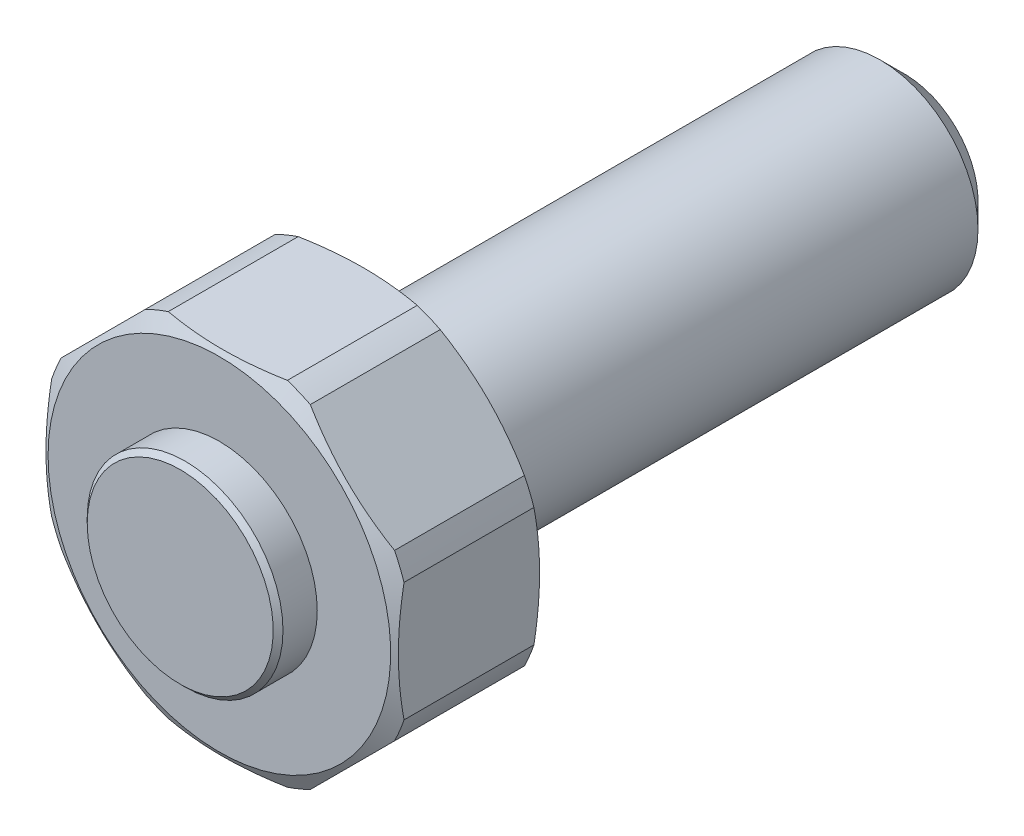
ISO-10303-21;
HEADER;
FILE_DESCRIPTION(('STEP AP214'),'2;1');
FILE_NAME('part.step','',(''),(''),'','','');
FILE_SCHEMA(('AUTOMOTIVE_DESIGN { 1 0 10303 214 1 1 1 1 }'));
ENDSEC;
DATA;
#1=APPLICATION_CONTEXT('core data for automotive mechanical design processes');
#2=APPLICATION_PROTOCOL_DEFINITION('international standard','automotive_design',2000,#1);
#3=PRODUCT_CONTEXT('',#1,'mechanical');
#4=PRODUCT('Part','Part','',(#3));
#5=PRODUCT_RELATED_PRODUCT_CATEGORY('part','',(#4));
#6=PRODUCT_DEFINITION_FORMATION('','',#4);
#7=PRODUCT_DEFINITION_CONTEXT('part definition',#1,'design');
#8=PRODUCT_DEFINITION('design','',#6,#7);
#9=PRODUCT_DEFINITION_SHAPE('','',#8);
#10=(LENGTH_UNIT() NAMED_UNIT(*) SI_UNIT(.MILLI.,.METRE.));
#11=(NAMED_UNIT(*) PLANE_ANGLE_UNIT() SI_UNIT($,.RADIAN.));
#12=(NAMED_UNIT(*) SI_UNIT($,.STERADIAN.) SOLID_ANGLE_UNIT());
#13=UNCERTAINTY_MEASURE_WITH_UNIT(LENGTH_MEASURE(1.E-05),#10,'distance_accuracy_value','');
#14=(GEOMETRIC_REPRESENTATION_CONTEXT(3) GLOBAL_UNCERTAINTY_ASSIGNED_CONTEXT((#13)) GLOBAL_UNIT_ASSIGNED_CONTEXT((#10,
#11,#12)) REPRESENTATION_CONTEXT('',''));
#15=CARTESIAN_POINT('',(0.,0.,0.));
#16=DIRECTION('',(0.,0.,1.));
#17=DIRECTION('',(1.,0.,0.));
#18=AXIS2_PLACEMENT_3D('',#15,#16,#17);
#19=CARTESIAN_POINT('',(0.,0.,5.));
#20=DIRECTION('',(0.,0.,1.));
#21=DIRECTION('',(1.,0.,0.));
#22=AXIS2_PLACEMENT_3D('',#19,#20,#21);
#23=CYLINDRICAL_SURFACE('',#22,10.);
#24=CARTESIAN_POINT('',(0.,0.,-52.5));
#25=DIRECTION('',(0.,0.,-1.));
#26=DIRECTION('',(-1.,0.,0.));
#27=AXIS2_PLACEMENT_3D('',#24,#25,#26);
#28=CIRCLE('',#27,10.);
#29=CARTESIAN_POINT('',(-10.,0.,-52.5));
#30=VERTEX_POINT('',#29);
#31=EDGE_CURVE('E9',#30,#30,#28,.F.);
#32=ORIENTED_EDGE('',*,*,#31,.T.);
#33=EDGE_LOOP('',(#32));
#34=FACE_BOUND('',#33,.T.);
#35=CARTESIAN_POINT('',(0.,0.,0.));
#36=DIRECTION('',(0.,0.,1.));
#37=DIRECTION('',(1.,0.,0.));
#38=AXIS2_PLACEMENT_3D('',#35,#36,#37);
#39=CIRCLE('',#38,10.);
#40=CARTESIAN_POINT('',(10.,0.,0.));
#41=VERTEX_POINT('',#40);
#42=EDGE_CURVE('E193',#41,#41,#39,.T.);
#43=ORIENTED_EDGE('',*,*,#42,.F.);
#44=EDGE_LOOP('',(#43));
#45=FACE_BOUND('',#44,.T.);
#46=ADVANCED_FACE('F14',(#34,#45),#23,.T.);
#47=CARTESIAN_POINT('',(10.,0.,0.));
#48=DIRECTION('',(0.,0.,1.));
#49=DIRECTION('',(1.,0.,0.));
#50=AXIS2_PLACEMENT_3D('',#47,#48,#49);
#51=PLANE('',#50);
#52=ORIENTED_EDGE('',*,*,#42,.T.);
#53=EDGE_LOOP('',(#52));
#54=FACE_BOUND('',#53,.T.);
#55=CARTESIAN_POINT('',(0.,0.,0.));
#56=DIRECTION('',(0.,0.,-1.));
#57=DIRECTION('',(-1.,0.,0.));
#58=AXIS2_PLACEMENT_3D('',#55,#56,#57);
#59=CIRCLE('',#58,17.5);
#60=CARTESIAN_POINT('',(-17.5,0.,0.));
#61=VERTEX_POINT('',#60);
#62=EDGE_CURVE('E369',#61,#61,#59,.T.);
#63=ORIENTED_EDGE('',*,*,#62,.T.);
#64=EDGE_LOOP('',(#63));
#65=FACE_BOUND('',#64,.T.);
#66=ADVANCED_FACE('F317',(#54,#65),#51,.F.);
#67=CARTESIAN_POINT('',(0.,0.,-75.));
#68=DIRECTION('',(0.,0.,-1.));
#69=DIRECTION('',(-1.,0.,0.));
#70=AXIS2_PLACEMENT_3D('',#67,#68,#69);
#71=CYLINDRICAL_SURFACE('',#70,19.);
#72=CARTESIAN_POINT('',(0.,0.,14.1339745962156));
#73=DIRECTION('',(0.,0.,-1.));
#74=DIRECTION('',(-1.,0.,0.));
#75=AXIS2_PLACEMENT_3D('',#72,#73,#74);
#76=CIRCLE('',#75,19.);
#77=CARTESIAN_POINT('',(6.08276253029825,-18.,14.1339745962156));
#78=VERTEX_POINT('',#77);
#79=CARTESIAN_POINT('',(8.42675942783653,-17.0290846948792,14.1339745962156));
#80=VERTEX_POINT('',#79);
#81=EDGE_CURVE('E482',#78,#80,#76,.F.);
#82=ORIENTED_EDGE('',*,*,#81,.F.);
#83=DIRECTION('',(0.,0.,-1.));
#84=VECTOR('',#83,1.);
#85=CARTESIAN_POINT('',(6.08276253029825,-18.,-75.));
#86=LINE('',#85,#84);
#87=CARTESIAN_POINT('',(6.08276253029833,-18.,0.866025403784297));
#88=VERTEX_POINT('',#87);
#89=EDGE_CURVE('E486',#78,#88,#86,.T.);
#90=ORIENTED_EDGE('',*,*,#89,.T.);
#91=CARTESIAN_POINT('',(0.,0.,0.866025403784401));
#92=DIRECTION('',(0.,0.,1.));
#93=DIRECTION('',(1.,0.,0.));
#94=AXIS2_PLACEMENT_3D('',#91,#92,#93);
#95=CIRCLE('',#94,19.);
#96=CARTESIAN_POINT('',(8.42675942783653,-17.0290846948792,0.866025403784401));
#97=VERTEX_POINT('',#96);
#98=EDGE_CURVE('E366',#97,#88,#95,.F.);
#99=ORIENTED_EDGE('',*,*,#98,.F.);
#100=DIRECTION('',(0.,0.,-1.));
#101=VECTOR('',#100,1.);
#102=CARTESIAN_POINT('',(8.42675942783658,-17.0290846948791,-75.));
#103=LINE('',#102,#101);
#104=EDGE_CURVE('E187',#80,#97,#103,.T.);
#105=ORIENTED_EDGE('',*,*,#104,.F.);
#106=EDGE_LOOP('',(#82,#90,#99,#105));
#107=FACE_BOUND('',#106,.T.);
#108=ADVANCED_FACE('F313',(#107),#71,.T.);
#109=CARTESIAN_POINT('',(18.,-6.08276253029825,0.866025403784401));
#110=VERTEX_POINT('',#109);
#111=CARTESIAN_POINT('',(17.0290846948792,-8.42675942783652,0.866025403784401));
#112=VERTEX_POINT('',#111);
#113=EDGE_CURVE('E29',#110,#112,#95,.F.);
#114=ORIENTED_EDGE('',*,*,#113,.F.);
#115=DIRECTION('',(0.,0.,-1.));
#116=VECTOR('',#115,1.);
#117=CARTESIAN_POINT('',(18.,-6.08276253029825,-75.));
#118=LINE('',#117,#116);
#119=CARTESIAN_POINT('',(18.,-6.08276253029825,14.1339745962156));
#120=VERTEX_POINT('',#119);
#121=EDGE_CURVE('E181',#120,#110,#118,.T.);
#122=ORIENTED_EDGE('',*,*,#121,.F.);
#123=CARTESIAN_POINT('',(17.0290846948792,-8.42675942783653,14.1339745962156));
#124=VERTEX_POINT('',#123);
#125=EDGE_CURVE('E476',#124,#120,#76,.F.);
#126=ORIENTED_EDGE('',*,*,#125,.F.);
#127=DIRECTION('',(0.,0.,-1.));
#128=VECTOR('',#127,1.);
#129=CARTESIAN_POINT('',(17.0290846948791,-8.42675942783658,-75.));
#130=LINE('',#129,#128);
#131=EDGE_CURVE('E184',#112,#124,#130,.F.);
#132=ORIENTED_EDGE('',*,*,#131,.F.);
#133=EDGE_LOOP('',(#114,#122,#126,#132));
#134=FACE_BOUND('',#133,.T.);
#135=ADVANCED_FACE('F316',(#134),#71,.T.);
#136=CARTESIAN_POINT('',(17.0290846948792,8.42675942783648,0.866025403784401));
#137=VERTEX_POINT('',#136);
#138=CARTESIAN_POINT('',(18.,6.08276253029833,0.866025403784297));
#139=VERTEX_POINT('',#138);
#140=EDGE_CURVE('E35',#137,#139,#95,.F.);
#141=ORIENTED_EDGE('',*,*,#140,.F.);
#142=DIRECTION('',(0.,0.,-1.));
#143=VECTOR('',#142,1.);
#144=CARTESIAN_POINT('',(17.0290846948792,8.42675942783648,-75.));
#145=LINE('',#144,#143);
#146=CARTESIAN_POINT('',(17.0290846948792,8.42675942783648,14.1339745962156));
#147=VERTEX_POINT('',#146);
#148=EDGE_CURVE('E175',#147,#137,#145,.T.);
#149=ORIENTED_EDGE('',*,*,#148,.F.);
#150=CARTESIAN_POINT('',(18.,6.08276253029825,14.1339745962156));
#151=VERTEX_POINT('',#150);
#152=EDGE_CURVE('E419',#151,#147,#76,.F.);
#153=ORIENTED_EDGE('',*,*,#152,.F.);
#154=DIRECTION('',(0.,0.,-1.));
#155=VECTOR('',#154,1.);
#156=CARTESIAN_POINT('',(18.,6.08276253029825,-75.));
#157=LINE('',#156,#155);
#158=EDGE_CURVE('E178',#139,#151,#157,.F.);
#159=ORIENTED_EDGE('',*,*,#158,.F.);
#160=EDGE_LOOP('',(#141,#149,#153,#159));
#161=FACE_BOUND('',#160,.T.);
#162=ADVANCED_FACE('F325',(#161),#71,.T.);
#163=CARTESIAN_POINT('',(6.08276253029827,18.,0.866025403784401));
#164=VERTEX_POINT('',#163);
#165=CARTESIAN_POINT('',(8.42675942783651,17.0290846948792,0.866025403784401));
#166=VERTEX_POINT('',#165);
#167=EDGE_CURVE('E440',#164,#166,#95,.F.);
#168=ORIENTED_EDGE('',*,*,#167,.F.);
#169=DIRECTION('',(0.,0.,-1.));
#170=VECTOR('',#169,1.);
#171=CARTESIAN_POINT('',(6.08276253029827,18.,-75.));
#172=LINE('',#171,#170);
#173=CARTESIAN_POINT('',(6.08276253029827,18.,14.1339745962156));
#174=VERTEX_POINT('',#173);
#175=EDGE_CURVE('E169',#174,#164,#172,.T.);
#176=ORIENTED_EDGE('',*,*,#175,.F.);
#177=CARTESIAN_POINT('',(8.42675942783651,17.0290846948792,14.1339745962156));
#178=VERTEX_POINT('',#177);
#179=EDGE_CURVE('E417',#178,#174,#76,.F.);
#180=ORIENTED_EDGE('',*,*,#179,.F.);
#181=DIRECTION('',(0.,0.,-1.));
#182=VECTOR('',#181,1.);
#183=CARTESIAN_POINT('',(8.42675942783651,17.0290846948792,-75.));
#184=LINE('',#183,#182);
#185=EDGE_CURVE('E172',#166,#178,#184,.F.);
#186=ORIENTED_EDGE('',*,*,#185,.F.);
#187=EDGE_LOOP('',(#168,#176,#180,#186));
#188=FACE_BOUND('',#187,.T.);
#189=ADVANCED_FACE('F424',(#188),#71,.T.);
#190=CARTESIAN_POINT('',(-8.42675942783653,17.0290846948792,0.866025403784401));
#191=VERTEX_POINT('',#190);
#192=CARTESIAN_POINT('',(-6.08276253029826,18.,0.866025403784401));
#193=VERTEX_POINT('',#192);
#194=EDGE_CURVE('E437',#191,#193,#95,.F.);
#195=ORIENTED_EDGE('',*,*,#194,.F.);
#196=DIRECTION('',(0.,0.,-1.));
#197=VECTOR('',#196,1.);
#198=CARTESIAN_POINT('',(-8.42675942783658,17.0290846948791,-75.));
#199=LINE('',#198,#197);
#200=CARTESIAN_POINT('',(-8.42675942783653,17.0290846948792,14.1339745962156));
#201=VERTEX_POINT('',#200);
#202=EDGE_CURVE('E158',#201,#191,#199,.T.);
#203=ORIENTED_EDGE('',*,*,#202,.F.);
#204=CARTESIAN_POINT('',(-6.08276253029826,18.,14.1339745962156));
#205=VERTEX_POINT('',#204);
#206=EDGE_CURVE('E365',#205,#201,#76,.F.);
#207=ORIENTED_EDGE('',*,*,#206,.F.);
#208=DIRECTION('',(0.,0.,-1.));
#209=VECTOR('',#208,1.);
#210=CARTESIAN_POINT('',(-6.08276253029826,18.,-75.));
#211=LINE('',#210,#209);
#212=EDGE_CURVE('E166',#193,#205,#211,.F.);
#213=ORIENTED_EDGE('',*,*,#212,.F.);
#214=EDGE_LOOP('',(#195,#203,#207,#213));
#215=FACE_BOUND('',#214,.T.);
#216=ADVANCED_FACE('F447',(#215),#71,.T.);
#217=DIRECTION('',(0.,0.,-1.));
#218=VECTOR('',#217,1.);
#219=CARTESIAN_POINT('',(-18.,-6.08276253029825,-75.));
#220=LINE('',#219,#218);
#221=CARTESIAN_POINT('',(-18.,-6.08276253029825,14.1339745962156));
#222=VERTEX_POINT('',#221);
#223=CARTESIAN_POINT('',(-18.,-6.08276253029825,0.866025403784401));
#224=VERTEX_POINT('',#223);
#225=EDGE_CURVE('E145',#222,#224,#220,.T.);
#226=ORIENTED_EDGE('',*,*,#225,.T.);
#227=CARTESIAN_POINT('',(-17.0290846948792,-8.4267594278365,0.866025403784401));
#228=VERTEX_POINT('',#227);
#229=EDGE_CURVE('E433',#228,#224,#95,.F.);
#230=ORIENTED_EDGE('',*,*,#229,.F.);
#231=DIRECTION('',(0.,0.,-1.));
#232=VECTOR('',#231,1.);
#233=CARTESIAN_POINT('',(-17.0290846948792,-8.4267594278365,-75.));
#234=LINE('',#233,#232);
#235=CARTESIAN_POINT('',(-17.0290846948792,-8.4267594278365,14.1339745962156));
#236=VERTEX_POINT('',#235);
#237=EDGE_CURVE('E148',#228,#236,#234,.F.);
#238=ORIENTED_EDGE('',*,*,#237,.T.);
#239=EDGE_CURVE('E131',#222,#236,#76,.F.);
#240=ORIENTED_EDGE('',*,*,#239,.F.);
#241=EDGE_LOOP('',(#226,#230,#238,#240));
#242=FACE_BOUND('',#241,.T.);
#243=ADVANCED_FACE('F143',(#242),#71,.T.);
#244=CARTESIAN_POINT('',(-18.,6.08276253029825,0.866025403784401));
#245=VERTEX_POINT('',#244);
#246=CARTESIAN_POINT('',(-17.0290846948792,8.42675942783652,0.866025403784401));
#247=VERTEX_POINT('',#246);
#248=EDGE_CURVE('E436',#245,#247,#95,.F.);
#249=ORIENTED_EDGE('',*,*,#248,.F.);
#250=DIRECTION('',(0.,0.,-1.));
#251=VECTOR('',#250,1.);
#252=CARTESIAN_POINT('',(-18.,6.08276253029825,-75.));
#253=LINE('',#252,#251);
#254=CARTESIAN_POINT('',(-18.,6.08276253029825,14.1339745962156));
#255=VERTEX_POINT('',#254);
#256=EDGE_CURVE('E155',#245,#255,#253,.F.);
#257=ORIENTED_EDGE('',*,*,#256,.T.);
#258=CARTESIAN_POINT('',(-17.0290846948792,8.42675942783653,14.1339745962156));
#259=VERTEX_POINT('',#258);
#260=EDGE_CURVE('E134',#259,#255,#76,.F.);
#261=ORIENTED_EDGE('',*,*,#260,.F.);
#262=DIRECTION('',(0.,0.,-1.));
#263=VECTOR('',#262,1.);
#264=CARTESIAN_POINT('',(-17.0290846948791,8.42675942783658,-75.));
#265=LINE('',#264,#263);
#266=EDGE_CURVE('E154',#247,#259,#265,.F.);
#267=ORIENTED_EDGE('',*,*,#266,.F.);
#268=EDGE_LOOP('',(#249,#257,#261,#267));
#269=FACE_BOUND('',#268,.T.);
#270=ADVANCED_FACE('F331',(#269),#71,.T.);
#271=DIRECTION('',(0.,0.,-1.));
#272=VECTOR('',#271,1.);
#273=CARTESIAN_POINT('',(-8.42675942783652,-17.0290846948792,-75.));
#274=LINE('',#273,#272);
#275=CARTESIAN_POINT('',(-8.42675942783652,-17.0290846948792,14.1339745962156));
#276=VERTEX_POINT('',#275);
#277=CARTESIAN_POINT('',(-8.42675942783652,-17.0290846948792,0.866025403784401));
#278=VERTEX_POINT('',#277);
#279=EDGE_CURVE('E160',#276,#278,#274,.T.);
#280=ORIENTED_EDGE('',*,*,#279,.T.);
#281=CARTESIAN_POINT('',(-6.08276253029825,-18.,0.866025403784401));
#282=VERTEX_POINT('',#281);
#283=EDGE_CURVE('E435',#282,#278,#95,.F.);
#284=ORIENTED_EDGE('',*,*,#283,.F.);
#285=DIRECTION('',(0.,0.,-1.));
#286=VECTOR('',#285,1.);
#287=CARTESIAN_POINT('',(-6.08276253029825,-18.,-75.));
#288=LINE('',#287,#286);
#289=CARTESIAN_POINT('',(-6.08276253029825,-18.,14.1339745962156));
#290=VERTEX_POINT('',#289);
#291=EDGE_CURVE('E211',#282,#290,#288,.F.);
#292=ORIENTED_EDGE('',*,*,#291,.T.);
#293=EDGE_CURVE('E150',#276,#290,#76,.F.);
#294=ORIENTED_EDGE('',*,*,#293,.F.);
#295=EDGE_LOOP('',(#280,#284,#292,#294));
#296=FACE_BOUND('',#295,.T.);
#297=ADVANCED_FACE('F222',(#296),#71,.T.);
#298=CARTESIAN_POINT('',(0.,0.,4.38296305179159));
#299=DIRECTION('',(0.,0.,1.));
#300=DIRECTION('',(1.,0.,0.));
#301=AXIS2_PLACEMENT_3D('',#298,#299,#300);
#302=CONICAL_SURFACE('',#301,25.0915146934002,1.0471975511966);
#303=CARTESIAN_POINT('',(17.0298497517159,-8.4259943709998,0.866225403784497));
#304=CARTESIAN_POINT('',(16.7279790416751,-8.72786508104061,0.787270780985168));
#305=CARTESIAN_POINT('',(16.4251282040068,-9.0307159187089,0.715579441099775));
#306=CARTESIAN_POINT('',(15.8177220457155,-9.63812207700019,0.587832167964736));
#307=CARTESIAN_POINT('',(15.5131663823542,-9.9426777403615,0.531779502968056));
#308=CARTESIAN_POINT('',(14.9026569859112,-10.5531871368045,0.436440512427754));
#309=CARTESIAN_POINT('',(14.5967029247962,-10.8591411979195,0.397158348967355));
#310=CARTESIAN_POINT('',(13.9839392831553,-11.4719048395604,0.336202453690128));
#311=CARTESIAN_POINT('',(13.6771297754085,-11.7787143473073,0.314527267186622));
#312=CARTESIAN_POINT('',(13.0674827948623,-12.3883613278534,0.28944273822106));
#313=CARTESIAN_POINT('',(12.7646505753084,-12.6911935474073,0.285779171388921));
#314=CARTESIAN_POINT('',(12.1591220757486,-13.2967220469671,0.296110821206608));
#315=CARTESIAN_POINT('',(11.8564258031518,-13.5994183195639,0.310106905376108));
#316=CARTESIAN_POINT('',(11.2518585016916,-14.2039856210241,0.355439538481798));
#317=CARTESIAN_POINT('',(10.9499871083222,-14.5058570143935,0.386766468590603));
#318=CARTESIAN_POINT('',(10.3473726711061,-15.1084714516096,0.466094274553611));
#319=CARTESIAN_POINT('',(10.0466295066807,-15.409214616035,0.514093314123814));
#320=CARTESIAN_POINT('',(9.63629143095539,-15.8195526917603,0.590500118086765));
#321=CARTESIAN_POINT('',(9.52604440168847,-15.9297997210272,0.612111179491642));
#322=CARTESIAN_POINT('',(9.30577444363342,-16.1500696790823,0.657403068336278));
#323=CARTESIAN_POINT('',(9.19575149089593,-16.2600926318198,0.681083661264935));
#324=CARTESIAN_POINT('',(8.97563723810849,-16.4802068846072,0.730526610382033));
#325=CARTESIAN_POINT('',(8.86554654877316,-16.5902975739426,0.756294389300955));
#326=CARTESIAN_POINT('',(8.64559368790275,-16.810250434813,0.809798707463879));
#327=CARTESIAN_POINT('',(8.53573153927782,-16.9201125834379,0.837535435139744));
#328=CARTESIAN_POINT('',(8.42599437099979,-17.0298497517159,0.866225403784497));
#329=B_SPLINE_CURVE_WITH_KNOTS('',3,(#303,#304,#305,#306,#307,#308,#309,#310,#311,#312,#313,
#314,#315,#316,#317,#318,#319,#320,#321,#322,#323,#324,#325,#326,#327,#328),.UNSPECIFIED.,.F.,
.F.,(4,2,2,2,2,2,2,2,2,2,2,2,4),(0.,1.3024481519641,2.60516829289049,3.90821155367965,
5.21114714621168,6.495638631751,7.78019321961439,9.06403557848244,10.3477365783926,
10.8199379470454,11.2920858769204,11.7655024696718,12.2389644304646),.UNSPECIFIED.);
#330=EDGE_CURVE('E275',#112,#97,#329,.T.);
#331=ORIENTED_EDGE('',*,*,#330,.T.);
#332=ORIENTED_EDGE('',*,*,#98,.T.);
#333=CARTESIAN_POINT('',(-22.5178938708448,-18.,6.540243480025));
#334=CARTESIAN_POINT('',(-22.1759841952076,-18.,6.3860547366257));
#335=CARTESIAN_POINT('',(-21.8335648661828,-18.,6.23299701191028));
#336=CARTESIAN_POINT('',(-21.147610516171,-18.,5.92938694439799));
#337=CARTESIAN_POINT('',(-20.804075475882,-18.,5.77883464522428));
#338=CARTESIAN_POINT('',(-19.771514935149,-18.,5.33124166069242));
#339=CARTESIAN_POINT('',(-19.0806880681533,-18.,5.03833461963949));
#340=CARTESIAN_POINT('',(-17.689331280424,-18.,4.46430506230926));
#341=CARTESIAN_POINT('',(-16.9887680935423,-18.,4.18326293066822));
#342=CARTESIAN_POINT('',(-15.5811351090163,-18.,3.63802615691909));
#343=CARTESIAN_POINT('',(-14.8740657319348,-18.,3.37383043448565));
#344=CARTESIAN_POINT('',(-13.4597077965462,-18.,2.86887983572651));
#345=CARTESIAN_POINT('',(-12.7524953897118,-18.,2.62791291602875));
#346=CARTESIAN_POINT('',(-11.3298390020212,-18.,2.17121904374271));
#347=CARTESIAN_POINT('',(-10.6143944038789,-18.,1.9554939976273));
#348=CARTESIAN_POINT('',(-9.17638376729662,-18.,1.5555580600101));
#349=CARTESIAN_POINT('',(-8.45383703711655,-18.,1.37127835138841));
#350=CARTESIAN_POINT('',(-7.00021814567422,-18.,1.04024366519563));
#351=CARTESIAN_POINT('',(-6.26914812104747,-18.,0.893479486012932));
#352=CARTESIAN_POINT('',(-5.1131533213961,-18.,0.697328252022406));
#353=CARTESIAN_POINT('',(-4.69071968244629,-18.,0.633113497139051));
#354=CARTESIAN_POINT('',(-3.84378122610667,-18.,0.520320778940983));
#355=CARTESIAN_POINT('',(-3.4192765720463,-18.,0.471741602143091));
#356=CARTESIAN_POINT('',(-2.56862221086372,-18.,0.391159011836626));
#357=CARTESIAN_POINT('',(-2.14247225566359,-18.,0.359158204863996));
#358=CARTESIAN_POINT('',(-1.28921701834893,-18.,0.312411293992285));
#359=CARTESIAN_POINT('',(-0.862111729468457,-18.,0.297665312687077));
#360=CARTESIAN_POINT('',(-0.00731534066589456,-18.,0.285745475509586));
#361=CARTESIAN_POINT('',(0.420375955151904,-18.,0.288585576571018));
#362=CARTESIAN_POINT('',(1.27527492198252,-18.,0.31180769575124));
#363=CARTESIAN_POINT('',(1.70248259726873,-18.,0.332189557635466));
#364=CARTESIAN_POINT('',(2.55559457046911,-18.,0.390045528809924));
#365=CARTESIAN_POINT('',(2.98149924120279,-18.,0.427514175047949));
#366=CARTESIAN_POINT('',(3.83158411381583,-18.,0.518776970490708));
#367=CARTESIAN_POINT('',(4.25576414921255,-18.,0.572572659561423));
#368=CARTESIAN_POINT('',(5.12133703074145,-18.,0.69829377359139));
#369=CARTESIAN_POINT('',(5.56262502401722,-18.,0.770938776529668));
#370=CARTESIAN_POINT('',(6.44240459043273,-18.,0.931622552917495));
#371=CARTESIAN_POINT('',(6.88089589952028,-18.,1.01966275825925));
#372=CARTESIAN_POINT('',(8.19209260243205,-18.,1.30476536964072));
#373=CARTESIAN_POINT('',(9.06027800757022,-18.,1.52277299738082));
#374=CARTESIAN_POINT('',(10.7873206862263,-18.,2.0041002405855));
#375=CARTESIAN_POINT('',(11.6461291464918,-18.,2.26759116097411));
#376=CARTESIAN_POINT('',(13.3520578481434,-18.,2.82936087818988));
#377=CARTESIAN_POINT('',(14.1991796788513,-18.,3.12763489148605));
#378=CARTESIAN_POINT('',(15.8938848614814,-18.,3.75503290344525));
#379=CARTESIAN_POINT('',(16.7413416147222,-18.,4.08449592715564));
#380=CARTESIAN_POINT('',(18.4276496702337,-18.,4.76484429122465));
#381=CARTESIAN_POINT('',(19.2665002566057,-18.,5.11573139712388));
#382=CARTESIAN_POINT('',(20.5153017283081,-18.,5.65287018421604));
#383=CARTESIAN_POINT('',(20.927988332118,-18.,5.8328091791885));
#384=CARTESIAN_POINT('',(21.7517491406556,-18.,6.1963496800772));
#385=CARTESIAN_POINT('',(22.1628233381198,-18.,6.37995120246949));
#386=CARTESIAN_POINT('',(22.98337613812,-18.,6.75035241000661));
#387=CARTESIAN_POINT('',(23.3928551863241,-18.,6.9371511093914));
#388=CARTESIAN_POINT('',(24.2104631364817,-18.,7.31366019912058));
#389=CARTESIAN_POINT('',(24.6185920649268,-18.,7.503370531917));
#390=CARTESIAN_POINT('',(25.0261141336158,-18.,7.6943700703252));
#391=B_SPLINE_CURVE_WITH_KNOTS('',3,(#333,#334,#335,#336,#337,#338,#339,#340,#341,#342,#343,
#344,#345,#346,#347,#348,#349,#350,#351,#352,#353,#354,#355,#356,#357,#358,#359,#360,#361,#362,
#363,#364,#365,#366,#367,#368,#369,#370,#371,#372,#373,#374,#375,#376,#377,#378,#379,#380,#381,
#382,#383,#384,#385,#386,#387,#388,#389,#390),.UNSPECIFIED.,.F.,.F.,(4,2,2,2,2,2,2,2,2,2,2,2,2,
2,2,2,2,2,2,2,2,2,2,2,2,2,2,2,4),(0.,1.12520172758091,2.2504230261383,4.50137287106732,
6.76570069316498,9.02988316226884,11.2709165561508,13.5121191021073,15.7483521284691,
17.9840361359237,19.2656462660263,20.54715690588,21.8288689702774,23.1105901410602,
24.393328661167,25.6760557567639,26.9583730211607,28.2408112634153,29.5821873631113,
30.9236882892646,33.6074252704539,36.3014998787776,38.9952044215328,41.7225809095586,
44.4501824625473,45.8007968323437,47.1514172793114,48.5016285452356,49.8518131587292),.UNSPECIFIED.);
#392=EDGE_CURVE('E202',#282,#88,#391,.T.);
#393=ORIENTED_EDGE('',*,*,#392,.F.);
#394=ORIENTED_EDGE('',*,*,#283,.T.);
#395=CARTESIAN_POINT('',(-17.0298497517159,-8.42599437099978,0.866225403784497));
#396=CARTESIAN_POINT('',(-16.7279790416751,-8.7278650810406,0.787270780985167));
#397=CARTESIAN_POINT('',(-16.4251282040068,-9.03071591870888,0.715579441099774));
#398=CARTESIAN_POINT('',(-15.8177220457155,-9.63812207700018,0.587832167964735));
#399=CARTESIAN_POINT('',(-15.5131663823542,-9.94267774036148,0.531779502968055));
#400=CARTESIAN_POINT('',(-14.9026569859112,-10.5531871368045,0.436440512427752));
#401=CARTESIAN_POINT('',(-14.5967029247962,-10.8591411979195,0.397158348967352));
#402=CARTESIAN_POINT('',(-13.9839392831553,-11.4719048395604,0.336202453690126));
#403=CARTESIAN_POINT('',(-13.6771297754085,-11.7787143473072,0.314527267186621));
#404=CARTESIAN_POINT('',(-13.0674827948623,-12.3883613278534,0.28944273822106));
#405=CARTESIAN_POINT('',(-12.7646505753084,-12.6911935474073,0.285779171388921));
#406=CARTESIAN_POINT('',(-12.1591220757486,-13.2967220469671,0.296110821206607));
#407=CARTESIAN_POINT('',(-11.8564258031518,-13.5994183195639,0.310106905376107));
#408=CARTESIAN_POINT('',(-11.2518585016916,-14.2039856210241,0.355439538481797));
#409=CARTESIAN_POINT('',(-10.9499871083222,-14.5058570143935,0.386766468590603));
#410=CARTESIAN_POINT('',(-10.3473726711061,-15.1084714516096,0.466094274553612));
#411=CARTESIAN_POINT('',(-10.0466295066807,-15.409214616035,0.514093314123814));
#412=CARTESIAN_POINT('',(-9.63629143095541,-15.8195526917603,0.590500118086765));
#413=CARTESIAN_POINT('',(-9.52604440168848,-15.9297997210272,0.612111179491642));
#414=CARTESIAN_POINT('',(-9.30577444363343,-16.1500696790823,0.657403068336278));
#415=CARTESIAN_POINT('',(-9.19575149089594,-16.2600926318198,0.681083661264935));
#416=CARTESIAN_POINT('',(-8.9756372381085,-16.4802068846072,0.730526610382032));
#417=CARTESIAN_POINT('',(-8.86554654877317,-16.5902975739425,0.756294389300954));
#418=CARTESIAN_POINT('',(-8.64559368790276,-16.810250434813,0.809798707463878));
#419=CARTESIAN_POINT('',(-8.53573153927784,-16.9201125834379,0.837535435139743));
#420=CARTESIAN_POINT('',(-8.42599437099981,-17.0298497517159,0.866225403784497));
#421=B_SPLINE_CURVE_WITH_KNOTS('',3,(#395,#396,#397,#398,#399,#400,#401,#402,#403,#404,#405,
#406,#407,#408,#409,#410,#411,#412,#413,#414,#415,#416,#417,#418,#419,#420),.UNSPECIFIED.,.F.,
.F.,(4,2,2,2,2,2,2,2,2,2,2,2,4),(0.,1.3024481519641,2.60516829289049,3.90821155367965,
5.21114714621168,6.495638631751,7.78019321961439,9.06403557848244,10.3477365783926,
10.8199379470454,11.2920858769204,11.7655024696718,12.2389644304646),.UNSPECIFIED.);
#422=EDGE_CURVE('E232',#228,#278,#421,.T.);
#423=ORIENTED_EDGE('',*,*,#422,.F.);
#424=ORIENTED_EDGE('',*,*,#229,.T.);
#425=CARTESIAN_POINT('',(-18.,-22.5178938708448,6.540243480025));
#426=CARTESIAN_POINT('',(-18.,-22.1759841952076,6.38605473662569));
#427=CARTESIAN_POINT('',(-18.,-21.8335648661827,6.23299701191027));
#428=CARTESIAN_POINT('',(-18.,-21.1476105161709,5.92938694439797));
#429=CARTESIAN_POINT('',(-18.,-20.804075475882,5.77883464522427));
#430=CARTESIAN_POINT('',(-18.,-19.7715149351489,5.33124166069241));
#431=CARTESIAN_POINT('',(-18.,-19.0806880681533,5.03833461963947));
#432=CARTESIAN_POINT('',(-18.,-17.689331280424,4.46430506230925));
#433=CARTESIAN_POINT('',(-18.,-16.9887680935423,4.18326293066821));
#434=CARTESIAN_POINT('',(-18.,-15.5811351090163,3.63802615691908));
#435=CARTESIAN_POINT('',(-18.,-14.8740657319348,3.37383043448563));
#436=CARTESIAN_POINT('',(-18.,-13.4597077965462,2.8688798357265));
#437=CARTESIAN_POINT('',(-18.,-12.7524953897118,2.62791291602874));
#438=CARTESIAN_POINT('',(-18.,-11.3298390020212,2.1712190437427));
#439=CARTESIAN_POINT('',(-18.,-10.6143944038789,1.95549399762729));
#440=CARTESIAN_POINT('',(-18.,-9.1763837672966,1.5555580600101));
#441=CARTESIAN_POINT('',(-18.,-8.45383703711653,1.3712783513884));
#442=CARTESIAN_POINT('',(-18.,-7.00021814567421,1.04024366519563));
#443=CARTESIAN_POINT('',(-18.,-6.26914812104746,0.893479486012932));
#444=CARTESIAN_POINT('',(-18.,-5.11315332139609,0.697328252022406));
#445=CARTESIAN_POINT('',(-18.,-4.69071968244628,0.633113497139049));
#446=CARTESIAN_POINT('',(-18.,-3.84378122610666,0.520320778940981));
#447=CARTESIAN_POINT('',(-18.,-3.41927657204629,0.471741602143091));
#448=CARTESIAN_POINT('',(-18.,-2.56862221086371,0.391159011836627));
#449=CARTESIAN_POINT('',(-18.,-2.14247225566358,0.359158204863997));
#450=CARTESIAN_POINT('',(-18.,-1.28921701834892,0.312411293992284));
#451=CARTESIAN_POINT('',(-18.,-0.862111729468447,0.297665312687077));
#452=CARTESIAN_POINT('',(-18.,-0.00731534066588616,0.285745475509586));
#453=CARTESIAN_POINT('',(-18.,0.420375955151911,0.288585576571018));
#454=CARTESIAN_POINT('',(-18.,1.27527492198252,0.31180769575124));
#455=CARTESIAN_POINT('',(-18.,1.70248259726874,0.332189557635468));
#456=CARTESIAN_POINT('',(-18.,2.55559457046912,0.390045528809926));
#457=CARTESIAN_POINT('',(-18.,2.9814992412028,0.427514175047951));
#458=CARTESIAN_POINT('',(-18.,3.83158411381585,0.51877697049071));
#459=CARTESIAN_POINT('',(-18.,4.25576414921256,0.572572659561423));
#460=CARTESIAN_POINT('',(-18.,5.12133703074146,0.69829377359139));
#461=CARTESIAN_POINT('',(-18.,5.56262502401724,0.770938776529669));
#462=CARTESIAN_POINT('',(-18.,6.44240459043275,0.931622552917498));
#463=CARTESIAN_POINT('',(-18.,6.88089589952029,1.01966275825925));
#464=CARTESIAN_POINT('',(-18.,8.19209260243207,1.30476536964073));
#465=CARTESIAN_POINT('',(-18.,9.06027800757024,1.52277299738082));
#466=CARTESIAN_POINT('',(-18.,10.7873206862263,2.00410024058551));
#467=CARTESIAN_POINT('',(-18.,11.6461291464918,2.26759116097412));
#468=CARTESIAN_POINT('',(-18.,13.3520578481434,2.82936087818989));
#469=CARTESIAN_POINT('',(-18.,14.1991796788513,3.12763489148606));
#470=CARTESIAN_POINT('',(-18.,15.8938848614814,3.75503290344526));
#471=CARTESIAN_POINT('',(-18.,16.7413416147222,4.08449592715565));
#472=CARTESIAN_POINT('',(-18.,18.4276496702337,4.76484429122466));
#473=CARTESIAN_POINT('',(-18.,19.2665002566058,5.1157313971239));
#474=CARTESIAN_POINT('',(-18.,20.5153017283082,5.65287018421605));
#475=CARTESIAN_POINT('',(-18.,20.927988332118,5.83280917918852));
#476=CARTESIAN_POINT('',(-18.,21.7517491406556,6.19634968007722));
#477=CARTESIAN_POINT('',(-18.,22.1628233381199,6.37995120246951));
#478=CARTESIAN_POINT('',(-18.,22.9833761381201,6.75035241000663));
#479=CARTESIAN_POINT('',(-18.,23.3928551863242,6.93715110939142));
#480=CARTESIAN_POINT('',(-18.,24.2104631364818,7.3136601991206));
#481=CARTESIAN_POINT('',(-18.,24.6185920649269,7.50337053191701));
#482=CARTESIAN_POINT('',(-18.,25.0261141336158,7.6943700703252));
#483=B_SPLINE_CURVE_WITH_KNOTS('',3,(#425,#426,#427,#428,#429,#430,#431,#432,#433,#434,#435,
#436,#437,#438,#439,#440,#441,#442,#443,#444,#445,#446,#447,#448,#449,#450,#451,#452,#453,#454,
#455,#456,#457,#458,#459,#460,#461,#462,#463,#464,#465,#466,#467,#468,#469,#470,#471,#472,#473,
#474,#475,#476,#477,#478,#479,#480,#481,#482),.UNSPECIFIED.,.F.,.F.,(4,2,2,2,2,2,2,2,2,2,2,2,2,
2,2,2,2,2,2,2,2,2,2,2,2,2,2,2,4),(0.,1.12520172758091,2.2504230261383,4.50137287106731,
6.76570069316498,9.02988316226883,11.2709165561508,13.5121191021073,15.7483521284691,
17.9840361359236,19.2656462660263,20.5471569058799,21.8288689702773,23.1105901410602,
24.3933286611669,25.6760557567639,26.9583730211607,28.2408112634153,29.5821873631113,
30.9236882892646,33.6074252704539,36.3014998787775,38.9952044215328,41.7225809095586,
44.4501824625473,45.8007968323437,47.1514172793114,48.5016285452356,49.8518131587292),.UNSPECIFIED.);
#484=EDGE_CURVE('E153',#245,#224,#483,.F.);
#485=ORIENTED_EDGE('',*,*,#484,.F.);
#486=ORIENTED_EDGE('',*,*,#248,.T.);
#487=CARTESIAN_POINT('',(-17.0298497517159,8.4259943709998,0.866225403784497));
#488=CARTESIAN_POINT('',(-16.7279790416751,8.72786508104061,0.787270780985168));
#489=CARTESIAN_POINT('',(-16.4251282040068,9.0307159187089,0.715579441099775));
#490=CARTESIAN_POINT('',(-15.8177220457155,9.63812207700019,0.587832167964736));
#491=CARTESIAN_POINT('',(-15.5131663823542,9.9426777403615,0.531779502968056));
#492=CARTESIAN_POINT('',(-14.9026569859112,10.5531871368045,0.436440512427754));
#493=CARTESIAN_POINT('',(-14.5967029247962,10.8591411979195,0.397158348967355));
#494=CARTESIAN_POINT('',(-13.9839392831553,11.4719048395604,0.336202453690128));
#495=CARTESIAN_POINT('',(-13.6771297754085,11.7787143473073,0.314527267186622));
#496=CARTESIAN_POINT('',(-13.0674827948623,12.3883613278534,0.28944273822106));
#497=CARTESIAN_POINT('',(-12.7646505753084,12.6911935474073,0.285779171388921));
#498=CARTESIAN_POINT('',(-12.1591220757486,13.2967220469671,0.296110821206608));
#499=CARTESIAN_POINT('',(-11.8564258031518,13.5994183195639,0.310106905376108));
#500=CARTESIAN_POINT('',(-11.2518585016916,14.2039856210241,0.355439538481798));
#501=CARTESIAN_POINT('',(-10.9499871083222,14.5058570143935,0.386766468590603));
#502=CARTESIAN_POINT('',(-10.3473726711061,15.1084714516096,0.466094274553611));
#503=CARTESIAN_POINT('',(-10.0466295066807,15.409214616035,0.514093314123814));
#504=CARTESIAN_POINT('',(-9.63629143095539,15.8195526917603,0.590500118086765));
#505=CARTESIAN_POINT('',(-9.52604440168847,15.9297997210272,0.612111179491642));
#506=CARTESIAN_POINT('',(-9.30577444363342,16.1500696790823,0.657403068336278));
#507=CARTESIAN_POINT('',(-9.19575149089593,16.2600926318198,0.681083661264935));
#508=CARTESIAN_POINT('',(-8.97563723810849,16.4802068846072,0.730526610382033));
#509=CARTESIAN_POINT('',(-8.86554654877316,16.5902975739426,0.756294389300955));
#510=CARTESIAN_POINT('',(-8.64559368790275,16.810250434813,0.809798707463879));
#511=CARTESIAN_POINT('',(-8.53573153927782,16.9201125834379,0.837535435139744));
#512=CARTESIAN_POINT('',(-8.42599437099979,17.0298497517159,0.866225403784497));
#513=B_SPLINE_CURVE_WITH_KNOTS('',3,(#487,#488,#489,#490,#491,#492,#493,#494,#495,#496,#497,
#498,#499,#500,#501,#502,#503,#504,#505,#506,#507,#508,#509,#510,#511,#512),.UNSPECIFIED.,.F.,
.F.,(4,2,2,2,2,2,2,2,2,2,2,2,4),(0.,1.3024481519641,2.60516829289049,3.90821155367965,
5.21114714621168,6.495638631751,7.78019321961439,9.06403557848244,10.3477365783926,
10.8199379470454,11.2920858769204,11.7655024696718,12.2389644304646),.UNSPECIFIED.);
#514=EDGE_CURVE('E247',#247,#191,#513,.T.);
#515=ORIENTED_EDGE('',*,*,#514,.T.);
#516=ORIENTED_EDGE('',*,*,#194,.T.);
#517=CARTESIAN_POINT('',(-22.5178938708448,18.,6.540243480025));
#518=CARTESIAN_POINT('',(-22.1759841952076,18.,6.3860547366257));
#519=CARTESIAN_POINT('',(-21.8335648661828,18.,6.23299701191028));
#520=CARTESIAN_POINT('',(-21.147610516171,18.,5.92938694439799));
#521=CARTESIAN_POINT('',(-20.804075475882,18.,5.77883464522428));
#522=CARTESIAN_POINT('',(-19.771514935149,18.,5.33124166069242));
#523=CARTESIAN_POINT('',(-19.0806880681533,18.,5.03833461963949));
#524=CARTESIAN_POINT('',(-17.689331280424,18.,4.46430506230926));
#525=CARTESIAN_POINT('',(-16.9887680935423,18.,4.18326293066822));
#526=CARTESIAN_POINT('',(-15.5811351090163,18.,3.63802615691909));
#527=CARTESIAN_POINT('',(-14.8740657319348,18.,3.37383043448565));
#528=CARTESIAN_POINT('',(-13.4597077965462,18.,2.86887983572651));
#529=CARTESIAN_POINT('',(-12.7524953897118,18.,2.62791291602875));
#530=CARTESIAN_POINT('',(-11.3298390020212,18.,2.17121904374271));
#531=CARTESIAN_POINT('',(-10.6143944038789,18.,1.9554939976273));
#532=CARTESIAN_POINT('',(-9.17638376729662,18.,1.5555580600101));
#533=CARTESIAN_POINT('',(-8.45383703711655,18.,1.37127835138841));
#534=CARTESIAN_POINT('',(-7.00021814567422,18.,1.04024366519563));
#535=CARTESIAN_POINT('',(-6.26914812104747,18.,0.893479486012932));
#536=CARTESIAN_POINT('',(-5.1131533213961,18.,0.697328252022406));
#537=CARTESIAN_POINT('',(-4.69071968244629,18.,0.63311349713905));
#538=CARTESIAN_POINT('',(-3.84378122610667,18.,0.520320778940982));
#539=CARTESIAN_POINT('',(-3.4192765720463,18.,0.47174160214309));
#540=CARTESIAN_POINT('',(-2.56862221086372,18.,0.391159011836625));
#541=CARTESIAN_POINT('',(-2.14247225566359,18.,0.359158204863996));
#542=CARTESIAN_POINT('',(-1.28921701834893,18.,0.312411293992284));
#543=CARTESIAN_POINT('',(-0.862111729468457,18.,0.297665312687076));
#544=CARTESIAN_POINT('',(-0.00731534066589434,18.,0.285745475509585));
#545=CARTESIAN_POINT('',(0.420375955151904,18.,0.288585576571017));
#546=CARTESIAN_POINT('',(1.27527492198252,18.,0.311807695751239));
#547=CARTESIAN_POINT('',(1.70248259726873,18.,0.332189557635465));
#548=CARTESIAN_POINT('',(2.55559457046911,18.,0.390045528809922));
#549=CARTESIAN_POINT('',(2.98149924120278,18.,0.427514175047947));
#550=CARTESIAN_POINT('',(3.83158411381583,18.,0.518776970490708));
#551=CARTESIAN_POINT('',(4.25576414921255,18.,0.572572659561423));
#552=CARTESIAN_POINT('',(5.12133703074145,18.,0.69829377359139));
#553=CARTESIAN_POINT('',(5.56262502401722,18.,0.770938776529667));
#554=CARTESIAN_POINT('',(6.44240459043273,18.,0.931622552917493));
#555=CARTESIAN_POINT('',(6.88089589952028,18.,1.01966275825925));
#556=CARTESIAN_POINT('',(8.19209260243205,18.,1.30476536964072));
#557=CARTESIAN_POINT('',(9.06027800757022,18.,1.52277299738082));
#558=CARTESIAN_POINT('',(10.7873206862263,18.,2.0041002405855));
#559=CARTESIAN_POINT('',(11.6461291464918,18.,2.26759116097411));
#560=CARTESIAN_POINT('',(13.3520578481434,18.,2.82936087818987));
#561=CARTESIAN_POINT('',(14.1991796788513,18.,3.12763489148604));
#562=CARTESIAN_POINT('',(15.8938848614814,18.,3.75503290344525));
#563=CARTESIAN_POINT('',(16.7413416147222,18.,4.08449592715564));
#564=CARTESIAN_POINT('',(18.4276496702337,18.,4.76484429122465));
#565=CARTESIAN_POINT('',(19.2665002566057,18.,5.11573139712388));
#566=CARTESIAN_POINT('',(20.5153017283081,18.,5.65287018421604));
#567=CARTESIAN_POINT('',(20.927988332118,18.,5.8328091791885));
#568=CARTESIAN_POINT('',(21.7517491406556,18.,6.1963496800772));
#569=CARTESIAN_POINT('',(22.1628233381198,18.,6.37995120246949));
#570=CARTESIAN_POINT('',(22.98337613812,18.,6.7503524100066));
#571=CARTESIAN_POINT('',(23.3928551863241,18.,6.9371511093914));
#572=CARTESIAN_POINT('',(24.2104631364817,18.,7.31366019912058));
#573=CARTESIAN_POINT('',(24.6185920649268,18.,7.503370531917));
#574=CARTESIAN_POINT('',(25.0261141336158,18.,7.6943700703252));
#575=B_SPLINE_CURVE_WITH_KNOTS('',3,(#517,#518,#519,#520,#521,#522,#523,#524,#525,#526,#527,
#528,#529,#530,#531,#532,#533,#534,#535,#536,#537,#538,#539,#540,#541,#542,#543,#544,#545,#546,
#547,#548,#549,#550,#551,#552,#553,#554,#555,#556,#557,#558,#559,#560,#561,#562,#563,#564,#565,
#566,#567,#568,#569,#570,#571,#572,#573,#574),.UNSPECIFIED.,.F.,.F.,(4,2,2,2,2,2,2,2,2,2,2,2,2,
2,2,2,2,2,2,2,2,2,2,2,2,2,2,2,4),(0.,1.12520172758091,2.25042302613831,4.50137287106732,
6.76570069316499,9.02988316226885,11.2709165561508,13.5121191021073,15.7483521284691,
17.9840361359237,19.2656462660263,20.54715690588,21.8288689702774,23.1105901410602,
24.393328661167,25.6760557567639,26.9583730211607,28.2408112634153,29.5821873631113,
30.9236882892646,33.607425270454,36.3014998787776,38.9952044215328,41.7225809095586,
44.4501824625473,45.8007968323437,47.1514172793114,48.5016285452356,49.8518131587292),.UNSPECIFIED.);
#576=EDGE_CURVE('E255',#193,#164,#575,.T.);
#577=ORIENTED_EDGE('',*,*,#576,.T.);
#578=ORIENTED_EDGE('',*,*,#167,.T.);
#579=CARTESIAN_POINT('',(8.42599437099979,17.0298497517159,0.866225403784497));
#580=CARTESIAN_POINT('',(8.7278650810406,16.7279790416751,0.787270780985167));
#581=CARTESIAN_POINT('',(9.03071591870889,16.4251282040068,0.715579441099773));
#582=CARTESIAN_POINT('',(9.63812207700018,15.8177220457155,0.587832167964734));
#583=CARTESIAN_POINT('',(9.94267774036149,15.5131663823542,0.531779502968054));
#584=CARTESIAN_POINT('',(10.5531871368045,14.9026569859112,0.436440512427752));
#585=CARTESIAN_POINT('',(10.8591411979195,14.5967029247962,0.397158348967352));
#586=CARTESIAN_POINT('',(11.4719048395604,13.9839392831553,0.336202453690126));
#587=CARTESIAN_POINT('',(11.7787143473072,13.6771297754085,0.31452726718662));
#588=CARTESIAN_POINT('',(12.3883613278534,13.0674827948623,0.289442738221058));
#589=CARTESIAN_POINT('',(12.6911935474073,12.7646505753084,0.285779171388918));
#590=CARTESIAN_POINT('',(13.2967220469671,12.1591220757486,0.296110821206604));
#591=CARTESIAN_POINT('',(13.5994183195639,11.8564258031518,0.310106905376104));
#592=CARTESIAN_POINT('',(14.2039856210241,11.2518585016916,0.355439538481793));
#593=CARTESIAN_POINT('',(14.5058570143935,10.9499871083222,0.386766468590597));
#594=CARTESIAN_POINT('',(15.1084714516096,10.3473726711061,0.466094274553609));
#595=CARTESIAN_POINT('',(15.409214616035,10.0466295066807,0.514093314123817));
#596=CARTESIAN_POINT('',(15.8195526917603,9.63629143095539,0.590500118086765));
#597=CARTESIAN_POINT('',(15.9297997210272,9.52604440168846,0.61211117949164));
#598=CARTESIAN_POINT('',(16.1500696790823,9.30577444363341,0.657403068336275));
#599=CARTESIAN_POINT('',(16.2600926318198,9.19575149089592,0.681083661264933));
#600=CARTESIAN_POINT('',(16.4802068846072,8.97563723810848,0.730526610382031));
#601=CARTESIAN_POINT('',(16.5902975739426,8.86554654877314,0.756294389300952));
#602=CARTESIAN_POINT('',(16.810250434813,8.64559368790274,0.809798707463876));
#603=CARTESIAN_POINT('',(16.9201125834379,8.5357315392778,0.837535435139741));
#604=CARTESIAN_POINT('',(17.0298497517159,8.42599437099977,0.866225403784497));
#605=B_SPLINE_CURVE_WITH_KNOTS('',3,(#579,#580,#581,#582,#583,#584,#585,#586,#587,#588,#589,
#590,#591,#592,#593,#594,#595,#596,#597,#598,#599,#600,#601,#602,#603,#604),.UNSPECIFIED.,.F.,
.F.,(4,2,2,2,2,2,2,2,2,2,2,2,4),(0.,1.3024481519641,2.60516829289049,3.90821155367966,
5.21114714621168,6.495638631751,7.78019321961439,9.06403557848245,10.3477365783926,
10.8199379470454,11.2920858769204,11.7655024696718,12.2389644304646),.UNSPECIFIED.);
#606=EDGE_CURVE('E262',#166,#137,#605,.T.);
#607=ORIENTED_EDGE('',*,*,#606,.T.);
#608=ORIENTED_EDGE('',*,*,#140,.T.);
#609=CARTESIAN_POINT('',(18.,-22.5178938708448,6.540243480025));
#610=CARTESIAN_POINT('',(18.,-22.1759841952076,6.3860547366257));
#611=CARTESIAN_POINT('',(18.,-21.8335648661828,6.23299701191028));
#612=CARTESIAN_POINT('',(18.,-21.147610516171,5.92938694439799));
#613=CARTESIAN_POINT('',(18.,-20.804075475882,5.77883464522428));
#614=CARTESIAN_POINT('',(18.,-19.771514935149,5.33124166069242));
#615=CARTESIAN_POINT('',(18.,-19.0806880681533,5.03833461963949));
#616=CARTESIAN_POINT('',(18.,-17.689331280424,4.46430506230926));
#617=CARTESIAN_POINT('',(18.,-16.9887680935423,4.18326293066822));
#618=CARTESIAN_POINT('',(18.,-15.5811351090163,3.63802615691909));
#619=CARTESIAN_POINT('',(18.,-14.8740657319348,3.37383043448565));
#620=CARTESIAN_POINT('',(18.,-13.4597077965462,2.86887983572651));
#621=CARTESIAN_POINT('',(18.,-12.7524953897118,2.62791291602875));
#622=CARTESIAN_POINT('',(18.,-11.3298390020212,2.17121904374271));
#623=CARTESIAN_POINT('',(18.,-10.6143944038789,1.9554939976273));
#624=CARTESIAN_POINT('',(18.,-9.17638376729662,1.5555580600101));
#625=CARTESIAN_POINT('',(18.,-8.45383703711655,1.37127835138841));
#626=CARTESIAN_POINT('',(18.,-7.00021814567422,1.04024366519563));
#627=CARTESIAN_POINT('',(18.,-6.26914812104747,0.893479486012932));
#628=CARTESIAN_POINT('',(18.,-5.1131533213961,0.697328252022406));
#629=CARTESIAN_POINT('',(18.,-4.69071968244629,0.633113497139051));
#630=CARTESIAN_POINT('',(18.,-3.84378122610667,0.520320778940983));
#631=CARTESIAN_POINT('',(18.,-3.4192765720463,0.471741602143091));
#632=CARTESIAN_POINT('',(18.,-2.56862221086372,0.391159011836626));
#633=CARTESIAN_POINT('',(18.,-2.14247225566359,0.359158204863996));
#634=CARTESIAN_POINT('',(18.,-1.28921701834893,0.312411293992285));
#635=CARTESIAN_POINT('',(18.,-0.862111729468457,0.297665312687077));
#636=CARTESIAN_POINT('',(18.,-0.00731534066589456,0.285745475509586));
#637=CARTESIAN_POINT('',(18.,0.420375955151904,0.288585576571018));
#638=CARTESIAN_POINT('',(18.,1.27527492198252,0.31180769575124));
#639=CARTESIAN_POINT('',(18.,1.70248259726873,0.332189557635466));
#640=CARTESIAN_POINT('',(18.,2.55559457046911,0.390045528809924));
#641=CARTESIAN_POINT('',(18.,2.98149924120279,0.427514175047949));
#642=CARTESIAN_POINT('',(18.,3.83158411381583,0.518776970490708));
#643=CARTESIAN_POINT('',(18.,4.25576414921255,0.572572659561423));
#644=CARTESIAN_POINT('',(18.,5.12133703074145,0.69829377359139));
#645=CARTESIAN_POINT('',(18.,5.56262502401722,0.770938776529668));
#646=CARTESIAN_POINT('',(18.,6.44240459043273,0.931622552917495));
#647=CARTESIAN_POINT('',(18.,6.88089589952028,1.01966275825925));
#648=CARTESIAN_POINT('',(18.,8.19209260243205,1.30476536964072));
#649=CARTESIAN_POINT('',(18.,9.06027800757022,1.52277299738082));
#650=CARTESIAN_POINT('',(18.,10.7873206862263,2.0041002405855));
#651=CARTESIAN_POINT('',(18.,11.6461291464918,2.26759116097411));
#652=CARTESIAN_POINT('',(18.,13.3520578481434,2.82936087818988));
#653=CARTESIAN_POINT('',(18.,14.1991796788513,3.12763489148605));
#654=CARTESIAN_POINT('',(18.,15.8938848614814,3.75503290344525));
#655=CARTESIAN_POINT('',(18.,16.7413416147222,4.08449592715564));
#656=CARTESIAN_POINT('',(18.,18.4276496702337,4.76484429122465));
#657=CARTESIAN_POINT('',(18.,19.2665002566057,5.11573139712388));
#658=CARTESIAN_POINT('',(18.,20.5153017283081,5.65287018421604));
#659=CARTESIAN_POINT('',(18.,20.927988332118,5.8328091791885));
#660=CARTESIAN_POINT('',(18.,21.7517491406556,6.1963496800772));
#661=CARTESIAN_POINT('',(18.,22.1628233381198,6.37995120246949));
#662=CARTESIAN_POINT('',(18.,22.98337613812,6.75035241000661));
#663=CARTESIAN_POINT('',(18.,23.3928551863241,6.9371511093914));
#664=CARTESIAN_POINT('',(18.,24.2104631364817,7.31366019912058));
#665=CARTESIAN_POINT('',(18.,24.6185920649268,7.503370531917));
#666=CARTESIAN_POINT('',(18.,25.0261141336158,7.6943700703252));
#667=B_SPLINE_CURVE_WITH_KNOTS('',3,(#609,#610,#611,#612,#613,#614,#615,#616,#617,#618,#619,
#620,#621,#622,#623,#624,#625,#626,#627,#628,#629,#630,#631,#632,#633,#634,#635,#636,#637,#638,
#639,#640,#641,#642,#643,#644,#645,#646,#647,#648,#649,#650,#651,#652,#653,#654,#655,#656,#657,
#658,#659,#660,#661,#662,#663,#664,#665,#666),.UNSPECIFIED.,.F.,.F.,(4,2,2,2,2,2,2,2,2,2,2,2,2,
2,2,2,2,2,2,2,2,2,2,2,2,2,2,2,4),(0.,1.12520172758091,2.2504230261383,4.50137287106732,
6.76570069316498,9.02988316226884,11.2709165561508,13.5121191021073,15.7483521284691,
17.9840361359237,19.2656462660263,20.54715690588,21.8288689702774,23.1105901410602,
24.393328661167,25.6760557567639,26.9583730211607,28.2408112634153,29.5821873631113,
30.9236882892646,33.6074252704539,36.3014998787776,38.9952044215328,41.7225809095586,
44.4501824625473,45.8007968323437,47.1514172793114,48.5016285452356,49.8518131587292),.UNSPECIFIED.);
#668=EDGE_CURVE('E269',#139,#110,#667,.F.);
#669=ORIENTED_EDGE('',*,*,#668,.T.);
#670=ORIENTED_EDGE('',*,*,#113,.T.);
#671=EDGE_LOOP('',(#331,#332,#393,#394,#423,#424,#485,#486,#515,#516,#577,#578,#607,#608,#669,#670));
#672=FACE_BOUND('',#671,.T.);
#673=ORIENTED_EDGE('',*,*,#62,.F.);
#674=EDGE_LOOP('',(#673));
#675=FACE_BOUND('',#674,.T.);
#676=ADVANCED_FACE('F217',(#672,#675),#302,.T.);
#677=CARTESIAN_POINT('',(0.,0.,15.));
#678=DIRECTION('',(0.,0.,-1.));
#679=DIRECTION('',(-1.,0.,0.));
#680=AXIS2_PLACEMENT_3D('',#677,#678,#679);
#681=CONICAL_SURFACE('',#680,17.5,1.0471975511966);
#682=CARTESIAN_POINT('',(8.42599437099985,-17.0298497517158,14.1337745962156));
#683=CARTESIAN_POINT('',(8.72786508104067,-16.727979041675,14.2127292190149));
#684=CARTESIAN_POINT('',(9.03071591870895,-16.4251282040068,14.2844205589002));
#685=CARTESIAN_POINT('',(9.63812207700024,-15.8177220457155,14.4121678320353));
#686=CARTESIAN_POINT('',(9.94267774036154,-15.5131663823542,14.4682204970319));
#687=CARTESIAN_POINT('',(10.5531871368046,-14.9026569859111,14.5635594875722));
#688=CARTESIAN_POINT('',(10.8591411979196,-14.5967029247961,14.6028416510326));
#689=CARTESIAN_POINT('',(11.4719048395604,-13.9839392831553,14.6637975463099));
#690=CARTESIAN_POINT('',(11.7787143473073,-13.6771297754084,14.6854727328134));
#691=CARTESIAN_POINT('',(12.3883613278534,-13.0674827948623,14.7105572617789));
#692=CARTESIAN_POINT('',(12.6911935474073,-12.7646505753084,14.7142208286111));
#693=CARTESIAN_POINT('',(13.2967220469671,-12.1591220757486,14.7038891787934));
#694=CARTESIAN_POINT('',(13.599418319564,-11.8564258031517,14.6898930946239));
#695=CARTESIAN_POINT('',(14.2039856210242,-11.2518585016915,14.6445604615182));
#696=CARTESIAN_POINT('',(14.5058570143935,-10.9499871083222,14.6132335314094));
#697=CARTESIAN_POINT('',(15.1084714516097,-10.347372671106,14.5339057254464));
#698=CARTESIAN_POINT('',(15.4092146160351,-10.0466295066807,14.4859066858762));
#699=CARTESIAN_POINT('',(15.8195526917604,-9.63629143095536,14.4094998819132));
#700=CARTESIAN_POINT('',(15.9297997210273,-9.52604440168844,14.3878888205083));
#701=CARTESIAN_POINT('',(16.1500696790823,-9.30577444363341,14.3425969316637));
#702=CARTESIAN_POINT('',(16.2600926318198,-9.19575149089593,14.3189163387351));
#703=CARTESIAN_POINT('',(16.4802068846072,-8.97563723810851,14.269473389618));
#704=CARTESIAN_POINT('',(16.5902975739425,-8.86554654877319,14.243705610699));
#705=CARTESIAN_POINT('',(16.8102504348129,-8.6455936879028,14.1902012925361));
#706=CARTESIAN_POINT('',(16.9201125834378,-8.53573153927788,14.1624645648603));
#707=CARTESIAN_POINT('',(17.0298497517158,-8.42599437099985,14.1337745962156));
#708=B_SPLINE_CURVE_WITH_KNOTS('',3,(#682,#683,#684,#685,#686,#687,#688,#689,#690,#691,#692,
#693,#694,#695,#696,#697,#698,#699,#700,#701,#702,#703,#704,#705,#706,#707),.UNSPECIFIED.,.F.,
.F.,(4,2,2,2,2,2,2,2,2,2,2,2,4),(0.,1.30244815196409,2.60516829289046,3.90821155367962,
5.21114714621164,6.49563863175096,7.78019321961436,9.06403557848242,10.3477365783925,
10.8199379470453,11.2920858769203,11.7655024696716,12.2389644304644),.UNSPECIFIED.);
#709=EDGE_CURVE('E299',#80,#124,#708,.T.);
#710=ORIENTED_EDGE('',*,*,#709,.T.);
#711=ORIENTED_EDGE('',*,*,#125,.T.);
#712=CARTESIAN_POINT('',(18.,-22.5178938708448,8.459756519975));
#713=CARTESIAN_POINT('',(18.,-22.1759841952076,8.6139452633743));
#714=CARTESIAN_POINT('',(18.,-21.8335648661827,8.76700298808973));
#715=CARTESIAN_POINT('',(18.,-21.1476105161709,9.07061305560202));
#716=CARTESIAN_POINT('',(18.,-20.804075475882,9.22116535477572));
#717=CARTESIAN_POINT('',(18.,-19.7715149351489,9.66875833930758));
#718=CARTESIAN_POINT('',(18.,-19.0806880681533,9.96166538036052));
#719=CARTESIAN_POINT('',(18.,-17.689331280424,10.5356949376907));
#720=CARTESIAN_POINT('',(18.,-16.9887680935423,10.8167370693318));
#721=CARTESIAN_POINT('',(18.,-15.5811351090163,11.3619738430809));
#722=CARTESIAN_POINT('',(18.,-14.8740657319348,11.6261695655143));
#723=CARTESIAN_POINT('',(18.,-13.4597077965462,12.1311201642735));
#724=CARTESIAN_POINT('',(18.,-12.7524953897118,12.3720870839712));
#725=CARTESIAN_POINT('',(18.,-11.3298390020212,12.8287809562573));
#726=CARTESIAN_POINT('',(18.,-10.6143944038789,13.0445060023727));
#727=CARTESIAN_POINT('',(18.,-9.17638376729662,13.4444419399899));
#728=CARTESIAN_POINT('',(18.,-8.45383703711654,13.6287216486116));
#729=CARTESIAN_POINT('',(18.,-7.00021814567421,13.9597563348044));
#730=CARTESIAN_POINT('',(18.,-6.26914812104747,14.1065205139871));
#731=CARTESIAN_POINT('',(18.,-5.1131533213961,14.3026717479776));
#732=CARTESIAN_POINT('',(18.,-4.69071968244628,14.3668865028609));
#733=CARTESIAN_POINT('',(18.,-3.84378122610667,14.479679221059));
#734=CARTESIAN_POINT('',(18.,-3.41927657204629,14.5282583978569));
#735=CARTESIAN_POINT('',(18.,-2.56862221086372,14.6088409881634));
#736=CARTESIAN_POINT('',(18.,-2.14247225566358,14.640841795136));
#737=CARTESIAN_POINT('',(18.,-1.28921701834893,14.6875887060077));
#738=CARTESIAN_POINT('',(18.,-0.862111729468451,14.7023346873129));
#739=CARTESIAN_POINT('',(18.,-0.00731534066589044,14.7142545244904));
#740=CARTESIAN_POINT('',(18.,0.420375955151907,14.711414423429));
#741=CARTESIAN_POINT('',(18.,1.27527492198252,14.6881923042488));
#742=CARTESIAN_POINT('',(18.,1.70248259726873,14.6678104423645));
#743=CARTESIAN_POINT('',(18.,2.55559457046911,14.6099544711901));
#744=CARTESIAN_POINT('',(18.,2.98149924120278,14.572485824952));
#745=CARTESIAN_POINT('',(18.,3.83158411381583,14.4812230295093));
#746=CARTESIAN_POINT('',(18.,4.25576414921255,14.4274273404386));
#747=CARTESIAN_POINT('',(18.,5.12133703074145,14.3017062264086));
#748=CARTESIAN_POINT('',(18.,5.56262502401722,14.2290612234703));
#749=CARTESIAN_POINT('',(18.,6.44240459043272,14.0683774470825));
#750=CARTESIAN_POINT('',(18.,6.88089589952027,13.9803372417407));
#751=CARTESIAN_POINT('',(18.,8.19209260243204,13.6952346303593));
#752=CARTESIAN_POINT('',(18.,9.0602780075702,13.4772270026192));
#753=CARTESIAN_POINT('',(18.,10.7873206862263,12.9958997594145));
#754=CARTESIAN_POINT('',(18.,11.6461291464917,12.7324088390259));
#755=CARTESIAN_POINT('',(18.,13.3520578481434,12.1706391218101));
#756=CARTESIAN_POINT('',(18.,14.1991796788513,11.872365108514));
#757=CARTESIAN_POINT('',(18.,15.8938848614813,11.2449670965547));
#758=CARTESIAN_POINT('',(18.,16.7413416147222,10.9155040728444));
#759=CARTESIAN_POINT('',(18.,18.4276496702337,10.2351557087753));
#760=CARTESIAN_POINT('',(18.,19.2665002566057,9.88426860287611));
#761=CARTESIAN_POINT('',(18.,20.5153017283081,9.34712981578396));
#762=CARTESIAN_POINT('',(18.,20.927988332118,9.16719082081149));
#763=CARTESIAN_POINT('',(18.,21.7517491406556,8.80365031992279));
#764=CARTESIAN_POINT('',(18.,22.1628233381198,8.6200487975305));
#765=CARTESIAN_POINT('',(18.,22.98337613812,8.24964758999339));
#766=CARTESIAN_POINT('',(18.,23.3928551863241,8.06284889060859));
#767=CARTESIAN_POINT('',(18.,24.2104631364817,7.68633980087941));
#768=CARTESIAN_POINT('',(18.,24.6185920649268,7.496629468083));
#769=CARTESIAN_POINT('',(18.,25.0261141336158,7.3056299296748));
#770=B_SPLINE_CURVE_WITH_KNOTS('',3,(#712,#713,#714,#715,#716,#717,#718,#719,#720,#721,#722,
#723,#724,#725,#726,#727,#728,#729,#730,#731,#732,#733,#734,#735,#736,#737,#738,#739,#740,#741,
#742,#743,#744,#745,#746,#747,#748,#749,#750,#751,#752,#753,#754,#755,#756,#757,#758,#759,#760,
#761,#762,#763,#764,#765,#766,#767,#768,#769),.UNSPECIFIED.,.F.,.F.,(4,2,2,2,2,2,2,2,2,2,2,2,2,
2,2,2,2,2,2,2,2,2,2,2,2,2,2,2,4),(0.,1.1252017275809,2.2504230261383,4.5013728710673,
6.76570069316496,9.02988316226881,11.2709165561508,13.5121191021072,15.7483521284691,
17.9840361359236,19.2656462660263,20.5471569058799,21.8288689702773,23.1105901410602,
24.3933286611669,25.6760557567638,26.9583730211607,28.2408112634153,29.5821873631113,
30.9236882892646,33.6074252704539,36.3014998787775,38.9952044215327,41.7225809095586,
44.4501824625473,45.8007968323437,47.1514172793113,48.5016285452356,49.8518131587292),.UNSPECIFIED.);
#771=EDGE_CURVE('E293',#120,#151,#770,.T.);
#772=ORIENTED_EDGE('',*,*,#771,.T.);
#773=ORIENTED_EDGE('',*,*,#152,.T.);
#774=CARTESIAN_POINT('',(17.0298497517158,8.42599437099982,14.1337745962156));
#775=CARTESIAN_POINT('',(16.727979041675,8.72786508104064,14.2127292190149));
#776=CARTESIAN_POINT('',(16.4251282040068,9.03071591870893,14.2844205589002));
#777=CARTESIAN_POINT('',(15.8177220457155,9.63812207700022,14.4121678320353));
#778=CARTESIAN_POINT('',(15.5131663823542,9.94267774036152,14.4682204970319));
#779=CARTESIAN_POINT('',(14.9026569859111,10.5531871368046,14.5635594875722));
#780=CARTESIAN_POINT('',(14.5967029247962,10.8591411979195,14.6028416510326));
#781=CARTESIAN_POINT('',(13.9839392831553,11.4719048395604,14.6637975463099));
#782=CARTESIAN_POINT('',(13.6771297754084,11.7787143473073,14.6854727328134));
#783=CARTESIAN_POINT('',(13.0674827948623,12.3883613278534,14.7105572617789));
#784=CARTESIAN_POINT('',(12.7646505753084,12.6911935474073,14.7142208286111));
#785=CARTESIAN_POINT('',(12.1591220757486,13.2967220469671,14.7038891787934));
#786=CARTESIAN_POINT('',(11.8564258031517,13.599418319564,14.6898930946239));
#787=CARTESIAN_POINT('',(11.2518585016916,14.2039856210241,14.6445604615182));
#788=CARTESIAN_POINT('',(10.9499871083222,14.5058570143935,14.6132335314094));
#789=CARTESIAN_POINT('',(10.3473726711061,15.1084714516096,14.5339057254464));
#790=CARTESIAN_POINT('',(10.0466295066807,15.409214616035,14.4859066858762));
#791=CARTESIAN_POINT('',(9.63629143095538,15.8195526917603,14.4094998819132));
#792=CARTESIAN_POINT('',(9.52604440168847,15.9297997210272,14.3878888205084));
#793=CARTESIAN_POINT('',(9.30577444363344,16.1500696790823,14.3425969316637));
#794=CARTESIAN_POINT('',(9.19575149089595,16.2600926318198,14.3189163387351));
#795=CARTESIAN_POINT('',(8.97563723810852,16.4802068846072,14.269473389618));
#796=CARTESIAN_POINT('',(8.8655465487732,16.5902975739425,14.243705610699));
#797=CARTESIAN_POINT('',(8.64559368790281,16.8102504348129,14.1902012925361));
#798=CARTESIAN_POINT('',(8.53573153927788,16.9201125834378,14.1624645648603));
#799=CARTESIAN_POINT('',(8.42599437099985,17.0298497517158,14.1337745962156));
#800=B_SPLINE_CURVE_WITH_KNOTS('',3,(#774,#775,#776,#777,#778,#779,#780,#781,#782,#783,#784,
#785,#786,#787,#788,#789,#790,#791,#792,#793,#794,#795,#796,#797,#798,#799),.UNSPECIFIED.,.F.,
.F.,(4,2,2,2,2,2,2,2,2,2,2,2,4),(0.,1.30244815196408,2.60516829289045,3.90821155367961,
5.21114714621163,6.49563863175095,7.78019321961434,9.06403557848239,10.3477365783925,
10.8199379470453,11.2920858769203,11.7655024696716,12.2389644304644),.UNSPECIFIED.);
#801=EDGE_CURVE('E300',#147,#178,#800,.T.);
#802=ORIENTED_EDGE('',*,*,#801,.T.);
#803=ORIENTED_EDGE('',*,*,#179,.T.);
#804=CARTESIAN_POINT('',(-22.5178938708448,18.,8.459756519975));
#805=CARTESIAN_POINT('',(-22.1759841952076,18.,8.6139452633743));
#806=CARTESIAN_POINT('',(-21.8335648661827,18.,8.76700298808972));
#807=CARTESIAN_POINT('',(-21.1476105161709,18.,9.07061305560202));
#808=CARTESIAN_POINT('',(-20.804075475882,18.,9.22116535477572));
#809=CARTESIAN_POINT('',(-19.7715149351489,18.,9.66875833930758));
#810=CARTESIAN_POINT('',(-19.0806880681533,18.,9.96166538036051));
#811=CARTESIAN_POINT('',(-17.689331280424,18.,10.5356949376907));
#812=CARTESIAN_POINT('',(-16.9887680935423,18.,10.8167370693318));
#813=CARTESIAN_POINT('',(-15.5811351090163,18.,11.3619738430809));
#814=CARTESIAN_POINT('',(-14.8740657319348,18.,11.6261695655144));
#815=CARTESIAN_POINT('',(-13.4597077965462,18.,12.1311201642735));
#816=CARTESIAN_POINT('',(-12.7524953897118,18.,12.3720870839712));
#817=CARTESIAN_POINT('',(-11.3298390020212,18.,12.8287809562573));
#818=CARTESIAN_POINT('',(-10.6143944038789,18.,13.0445060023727));
#819=CARTESIAN_POINT('',(-9.17638376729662,18.,13.4444419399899));
#820=CARTESIAN_POINT('',(-8.45383703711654,18.,13.6287216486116));
#821=CARTESIAN_POINT('',(-7.00021814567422,18.,13.9597563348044));
#822=CARTESIAN_POINT('',(-6.26914812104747,18.,14.1065205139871));
#823=CARTESIAN_POINT('',(-5.1131533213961,18.,14.3026717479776));
#824=CARTESIAN_POINT('',(-4.69071968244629,18.,14.3668865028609));
#825=CARTESIAN_POINT('',(-3.84378122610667,18.,14.479679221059));
#826=CARTESIAN_POINT('',(-3.4192765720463,18.,14.5282583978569));
#827=CARTESIAN_POINT('',(-2.56862221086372,18.,14.6088409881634));
#828=CARTESIAN_POINT('',(-2.14247225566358,18.,14.640841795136));
#829=CARTESIAN_POINT('',(-1.28921701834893,18.,14.6875887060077));
#830=CARTESIAN_POINT('',(-0.862111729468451,18.,14.7023346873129));
#831=CARTESIAN_POINT('',(-0.00731534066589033,18.,14.7142545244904));
#832=CARTESIAN_POINT('',(0.420375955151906,18.,14.711414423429));
#833=CARTESIAN_POINT('',(1.27527492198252,18.,14.6881923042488));
#834=CARTESIAN_POINT('',(1.70248259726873,18.,14.6678104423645));
#835=CARTESIAN_POINT('',(2.55559457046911,18.,14.6099544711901));
#836=CARTESIAN_POINT('',(2.98149924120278,18.,14.572485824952));
#837=CARTESIAN_POINT('',(3.83158411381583,18.,14.4812230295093));
#838=CARTESIAN_POINT('',(4.25576414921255,18.,14.4274273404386));
#839=CARTESIAN_POINT('',(5.12133703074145,18.,14.3017062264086));
#840=CARTESIAN_POINT('',(5.56262502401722,18.,14.2290612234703));
#841=CARTESIAN_POINT('',(6.44240459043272,18.,14.0683774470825));
#842=CARTESIAN_POINT('',(6.88089589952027,18.,13.9803372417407));
#843=CARTESIAN_POINT('',(8.19209260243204,18.,13.6952346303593));
#844=CARTESIAN_POINT('',(9.0602780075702,18.,13.4772270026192));
#845=CARTESIAN_POINT('',(10.7873206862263,18.,12.9958997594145));
#846=CARTESIAN_POINT('',(11.6461291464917,18.,12.7324088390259));
#847=CARTESIAN_POINT('',(13.3520578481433,18.,12.1706391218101));
#848=CARTESIAN_POINT('',(14.1991796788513,18.,11.872365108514));
#849=CARTESIAN_POINT('',(15.8938848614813,18.,11.2449670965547));
#850=CARTESIAN_POINT('',(16.7413416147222,18.,10.9155040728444));
#851=CARTESIAN_POINT('',(18.4276496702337,18.,10.2351557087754));
#852=CARTESIAN_POINT('',(19.2665002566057,18.,9.88426860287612));
#853=CARTESIAN_POINT('',(20.5153017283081,18.,9.34712981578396));
#854=CARTESIAN_POINT('',(20.927988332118,18.,9.16719082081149));
#855=CARTESIAN_POINT('',(21.7517491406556,18.,8.80365031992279));
#856=CARTESIAN_POINT('',(22.1628233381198,18.,8.6200487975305));
#857=CARTESIAN_POINT('',(22.98337613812,18.,8.24964758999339));
#858=CARTESIAN_POINT('',(23.3928551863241,18.,8.06284889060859));
#859=CARTESIAN_POINT('',(24.2104631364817,18.,7.68633980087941));
#860=CARTESIAN_POINT('',(24.6185920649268,18.,7.496629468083));
#861=CARTESIAN_POINT('',(25.0261141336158,18.,7.3056299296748));
#862=B_SPLINE_CURVE_WITH_KNOTS('',3,(#804,#805,#806,#807,#808,#809,#810,#811,#812,#813,#814,
#815,#816,#817,#818,#819,#820,#821,#822,#823,#824,#825,#826,#827,#828,#829,#830,#831,#832,#833,
#834,#835,#836,#837,#838,#839,#840,#841,#842,#843,#844,#845,#846,#847,#848,#849,#850,#851,#852,
#853,#854,#855,#856,#857,#858,#859,#860,#861),.UNSPECIFIED.,.F.,.F.,(4,2,2,2,2,2,2,2,2,2,2,2,2,
2,2,2,2,2,2,2,2,2,2,2,2,2,2,2,4),(0.,1.1252017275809,2.25042302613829,4.5013728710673,
6.76570069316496,9.02988316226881,11.2709165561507,13.5121191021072,15.7483521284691,
17.9840361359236,19.2656462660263,20.5471569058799,21.8288689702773,23.1105901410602,
24.3933286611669,25.6760557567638,26.9583730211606,28.2408112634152,29.5821873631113,
30.9236882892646,33.6074252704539,36.3014998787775,38.9952044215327,41.7225809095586,
44.4501824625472,45.8007968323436,47.1514172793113,48.5016285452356,49.8518131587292),.UNSPECIFIED.);
#863=EDGE_CURVE('E405',#174,#205,#862,.F.);
#864=ORIENTED_EDGE('',*,*,#863,.T.);
#865=ORIENTED_EDGE('',*,*,#206,.T.);
#866=CARTESIAN_POINT('',(-8.42599437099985,17.0298497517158,14.1337745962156));
#867=CARTESIAN_POINT('',(-8.72786508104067,16.727979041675,14.2127292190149));
#868=CARTESIAN_POINT('',(-9.03071591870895,16.4251282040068,14.2844205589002));
#869=CARTESIAN_POINT('',(-9.63812207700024,15.8177220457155,14.4121678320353));
#870=CARTESIAN_POINT('',(-9.94267774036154,15.5131663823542,14.4682204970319));
#871=CARTESIAN_POINT('',(-10.5531871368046,14.9026569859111,14.5635594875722));
#872=CARTESIAN_POINT('',(-10.8591411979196,14.5967029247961,14.6028416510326));
#873=CARTESIAN_POINT('',(-11.4719048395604,13.9839392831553,14.6637975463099));
#874=CARTESIAN_POINT('',(-11.7787143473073,13.6771297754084,14.6854727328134));
#875=CARTESIAN_POINT('',(-12.3883613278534,13.0674827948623,14.7105572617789));
#876=CARTESIAN_POINT('',(-12.6911935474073,12.7646505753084,14.7142208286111));
#877=CARTESIAN_POINT('',(-13.2967220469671,12.1591220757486,14.7038891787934));
#878=CARTESIAN_POINT('',(-13.599418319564,11.8564258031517,14.6898930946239));
#879=CARTESIAN_POINT('',(-14.2039856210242,11.2518585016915,14.6445604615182));
#880=CARTESIAN_POINT('',(-14.5058570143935,10.9499871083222,14.6132335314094));
#881=CARTESIAN_POINT('',(-15.1084714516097,10.347372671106,14.5339057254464));
#882=CARTESIAN_POINT('',(-15.4092146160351,10.0466295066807,14.4859066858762));
#883=CARTESIAN_POINT('',(-15.8195526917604,9.63629143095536,14.4094998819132));
#884=CARTESIAN_POINT('',(-15.9297997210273,9.52604440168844,14.3878888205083));
#885=CARTESIAN_POINT('',(-16.1500696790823,9.30577444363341,14.3425969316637));
#886=CARTESIAN_POINT('',(-16.2600926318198,9.19575149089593,14.3189163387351));
#887=CARTESIAN_POINT('',(-16.4802068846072,8.97563723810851,14.269473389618));
#888=CARTESIAN_POINT('',(-16.5902975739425,8.86554654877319,14.243705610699));
#889=CARTESIAN_POINT('',(-16.8102504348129,8.6455936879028,14.1902012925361));
#890=CARTESIAN_POINT('',(-16.9201125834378,8.53573153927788,14.1624645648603));
#891=CARTESIAN_POINT('',(-17.0298497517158,8.42599437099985,14.1337745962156));
#892=B_SPLINE_CURVE_WITH_KNOTS('',3,(#866,#867,#868,#869,#870,#871,#872,#873,#874,#875,#876,
#877,#878,#879,#880,#881,#882,#883,#884,#885,#886,#887,#888,#889,#890,#891),.UNSPECIFIED.,.F.,
.F.,(4,2,2,2,2,2,2,2,2,2,2,2,4),(0.,1.30244815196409,2.60516829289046,3.90821155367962,
5.21114714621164,6.49563863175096,7.78019321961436,9.06403557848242,10.3477365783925,
10.8199379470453,11.2920858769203,11.7655024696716,12.2389644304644),.UNSPECIFIED.);
#893=EDGE_CURVE('E138',#201,#259,#892,.T.);
#894=ORIENTED_EDGE('',*,*,#893,.T.);
#895=ORIENTED_EDGE('',*,*,#260,.T.);
#896=CARTESIAN_POINT('',(-18.,-22.5178938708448,8.459756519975));
#897=CARTESIAN_POINT('',(-18.,-22.1759841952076,8.61394526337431));
#898=CARTESIAN_POINT('',(-18.,-21.8335648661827,8.76700298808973));
#899=CARTESIAN_POINT('',(-18.,-21.1476105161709,9.07061305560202));
#900=CARTESIAN_POINT('',(-18.,-20.804075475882,9.22116535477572));
#901=CARTESIAN_POINT('',(-18.,-19.7715149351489,9.66875833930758));
#902=CARTESIAN_POINT('',(-18.,-19.0806880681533,9.96166538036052));
#903=CARTESIAN_POINT('',(-18.,-17.689331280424,10.5356949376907));
#904=CARTESIAN_POINT('',(-18.,-16.9887680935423,10.8167370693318));
#905=CARTESIAN_POINT('',(-18.,-15.5811351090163,11.3619738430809));
#906=CARTESIAN_POINT('',(-18.,-14.8740657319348,11.6261695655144));
#907=CARTESIAN_POINT('',(-18.,-13.4597077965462,12.1311201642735));
#908=CARTESIAN_POINT('',(-18.,-12.7524953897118,12.3720870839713));
#909=CARTESIAN_POINT('',(-18.,-11.3298390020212,12.8287809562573));
#910=CARTESIAN_POINT('',(-18.,-10.6143944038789,13.0445060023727));
#911=CARTESIAN_POINT('',(-18.,-9.1763837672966,13.4444419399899));
#912=CARTESIAN_POINT('',(-18.,-8.45383703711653,13.6287216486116));
#913=CARTESIAN_POINT('',(-18.,-7.0002181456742,13.9597563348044));
#914=CARTESIAN_POINT('',(-18.,-6.26914812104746,14.1065205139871));
#915=CARTESIAN_POINT('',(-18.,-5.11315332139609,14.3026717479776));
#916=CARTESIAN_POINT('',(-18.,-4.69071968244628,14.3668865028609));
#917=CARTESIAN_POINT('',(-18.,-3.84378122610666,14.479679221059));
#918=CARTESIAN_POINT('',(-18.,-3.41927657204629,14.5282583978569));
#919=CARTESIAN_POINT('',(-18.,-2.56862221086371,14.6088409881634));
#920=CARTESIAN_POINT('',(-18.,-2.14247225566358,14.640841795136));
#921=CARTESIAN_POINT('',(-18.,-1.28921701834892,14.6875887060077));
#922=CARTESIAN_POINT('',(-18.,-0.862111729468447,14.7023346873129));
#923=CARTESIAN_POINT('',(-18.,-0.00731534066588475,14.7142545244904));
#924=CARTESIAN_POINT('',(-18.,0.420375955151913,14.711414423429));
#925=CARTESIAN_POINT('',(-18.,1.27527492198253,14.6881923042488));
#926=CARTESIAN_POINT('',(-18.,1.70248259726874,14.6678104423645));
#927=CARTESIAN_POINT('',(-18.,2.55559457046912,14.6099544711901));
#928=CARTESIAN_POINT('',(-18.,2.98149924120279,14.572485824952));
#929=CARTESIAN_POINT('',(-18.,3.83158411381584,14.4812230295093));
#930=CARTESIAN_POINT('',(-18.,4.25576414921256,14.4274273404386));
#931=CARTESIAN_POINT('',(-18.,5.12133703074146,14.3017062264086));
#932=CARTESIAN_POINT('',(-18.,5.56262502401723,14.2290612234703));
#933=CARTESIAN_POINT('',(-18.,6.44240459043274,14.0683774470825));
#934=CARTESIAN_POINT('',(-18.,6.88089589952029,13.9803372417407));
#935=CARTESIAN_POINT('',(-18.,8.19209260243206,13.6952346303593));
#936=CARTESIAN_POINT('',(-18.,9.06027800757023,13.4772270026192));
#937=CARTESIAN_POINT('',(-18.,10.7873206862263,12.9958997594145));
#938=CARTESIAN_POINT('',(-18.,11.6461291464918,12.7324088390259));
#939=CARTESIAN_POINT('',(-18.,13.3520578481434,12.1706391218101));
#940=CARTESIAN_POINT('',(-18.,14.1991796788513,11.8723651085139));
#941=CARTESIAN_POINT('',(-18.,15.8938848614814,11.2449670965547));
#942=CARTESIAN_POINT('',(-18.,16.7413416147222,10.9155040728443));
#943=CARTESIAN_POINT('',(-18.,18.4276496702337,10.2351557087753));
#944=CARTESIAN_POINT('',(-18.,19.2665002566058,9.8842686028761));
#945=CARTESIAN_POINT('',(-18.,20.5153017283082,9.34712981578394));
#946=CARTESIAN_POINT('',(-18.,20.927988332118,9.16719082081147));
#947=CARTESIAN_POINT('',(-18.,21.7517491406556,8.80365031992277));
#948=CARTESIAN_POINT('',(-18.,22.1628233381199,8.62004879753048));
#949=CARTESIAN_POINT('',(-18.,22.9833761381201,8.24964758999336));
#950=CARTESIAN_POINT('',(-18.,23.3928551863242,8.06284889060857));
#951=CARTESIAN_POINT('',(-18.,24.2104631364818,7.68633980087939));
#952=CARTESIAN_POINT('',(-18.,24.6185920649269,7.49662946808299));
#953=CARTESIAN_POINT('',(-18.,25.0261141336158,7.3056299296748));
#954=B_SPLINE_CURVE_WITH_KNOTS('',3,(#896,#897,#898,#899,#900,#901,#902,#903,#904,#905,#906,
#907,#908,#909,#910,#911,#912,#913,#914,#915,#916,#917,#918,#919,#920,#921,#922,#923,#924,#925,
#926,#927,#928,#929,#930,#931,#932,#933,#934,#935,#936,#937,#938,#939,#940,#941,#942,#943,#944,
#945,#946,#947,#948,#949,#950,#951,#952,#953),.UNSPECIFIED.,.F.,.F.,(4,2,2,2,2,2,2,2,2,2,2,2,2,
2,2,2,2,2,2,2,2,2,2,2,2,2,2,2,4),(0.,1.12520172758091,2.2504230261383,4.50137287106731,
6.76570069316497,9.02988316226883,11.2709165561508,13.5121191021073,15.7483521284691,
17.9840361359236,19.2656462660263,20.5471569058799,21.8288689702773,23.1105901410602,
24.3933286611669,25.6760557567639,26.9583730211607,28.2408112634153,29.5821873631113,
30.9236882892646,33.6074252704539,36.3014998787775,38.9952044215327,41.7225809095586,
44.4501824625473,45.8007968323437,47.1514172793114,48.5016285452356,49.8518131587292),.UNSPECIFIED.);
#955=EDGE_CURVE('E127',#222,#255,#954,.T.);
#956=ORIENTED_EDGE('',*,*,#955,.F.);
#957=ORIENTED_EDGE('',*,*,#239,.T.);
#958=CARTESIAN_POINT('',(-8.42599437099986,-17.0298497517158,14.1337745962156));
#959=CARTESIAN_POINT('',(-8.72786508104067,-16.727979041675,14.2127292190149));
#960=CARTESIAN_POINT('',(-9.03071591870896,-16.4251282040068,14.2844205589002));
#961=CARTESIAN_POINT('',(-9.63812207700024,-15.8177220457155,14.4121678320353));
#962=CARTESIAN_POINT('',(-9.94267774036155,-15.5131663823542,14.4682204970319));
#963=CARTESIAN_POINT('',(-10.5531871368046,-14.9026569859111,14.5635594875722));
#964=CARTESIAN_POINT('',(-10.8591411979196,-14.5967029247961,14.6028416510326));
#965=CARTESIAN_POINT('',(-11.4719048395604,-13.9839392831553,14.6637975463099));
#966=CARTESIAN_POINT('',(-11.7787143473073,-13.6771297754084,14.6854727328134));
#967=CARTESIAN_POINT('',(-12.3883613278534,-13.0674827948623,14.7105572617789));
#968=CARTESIAN_POINT('',(-12.6911935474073,-12.7646505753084,14.7142208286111));
#969=CARTESIAN_POINT('',(-13.2967220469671,-12.1591220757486,14.7038891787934));
#970=CARTESIAN_POINT('',(-13.599418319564,-11.8564258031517,14.6898930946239));
#971=CARTESIAN_POINT('',(-14.2039856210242,-11.2518585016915,14.6445604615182));
#972=CARTESIAN_POINT('',(-14.5058570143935,-10.9499871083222,14.6132335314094));
#973=CARTESIAN_POINT('',(-15.1084714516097,-10.347372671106,14.5339057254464));
#974=CARTESIAN_POINT('',(-15.4092146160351,-10.0466295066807,14.4859066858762));
#975=CARTESIAN_POINT('',(-15.8195526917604,-9.63629143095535,14.4094998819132));
#976=CARTESIAN_POINT('',(-15.9297997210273,-9.52604440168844,14.3878888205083));
#977=CARTESIAN_POINT('',(-16.1500696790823,-9.30577444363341,14.3425969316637));
#978=CARTESIAN_POINT('',(-16.2600926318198,-9.19575149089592,14.3189163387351));
#979=CARTESIAN_POINT('',(-16.4802068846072,-8.9756372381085,14.269473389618));
#980=CARTESIAN_POINT('',(-16.5902975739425,-8.86554654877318,14.243705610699));
#981=CARTESIAN_POINT('',(-16.8102504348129,-8.64559368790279,14.1902012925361));
#982=CARTESIAN_POINT('',(-16.9201125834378,-8.53573153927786,14.1624645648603));
#983=CARTESIAN_POINT('',(-17.0298497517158,-8.42599437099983,14.1337745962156));
#984=B_SPLINE_CURVE_WITH_KNOTS('',3,(#958,#959,#960,#961,#962,#963,#964,#965,#966,#967,#968,
#969,#970,#971,#972,#973,#974,#975,#976,#977,#978,#979,#980,#981,#982,#983),.UNSPECIFIED.,.F.,
.F.,(4,2,2,2,2,2,2,2,2,2,2,2,4),(0.,1.30244815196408,2.60516829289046,3.90821155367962,
5.21114714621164,6.49563863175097,7.78019321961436,9.06403557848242,10.3477365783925,
10.8199379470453,11.2920858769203,11.7655024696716,12.2389644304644),.UNSPECIFIED.);
#985=EDGE_CURVE('E139',#276,#236,#984,.T.);
#986=ORIENTED_EDGE('',*,*,#985,.F.);
#987=ORIENTED_EDGE('',*,*,#293,.T.);
#988=CARTESIAN_POINT('',(-22.5178938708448,-18.,8.459756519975));
#989=CARTESIAN_POINT('',(-22.1759841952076,-18.,8.6139452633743));
#990=CARTESIAN_POINT('',(-21.8335648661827,-18.,8.76700298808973));
#991=CARTESIAN_POINT('',(-21.1476105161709,-18.,9.07061305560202));
#992=CARTESIAN_POINT('',(-20.804075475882,-18.,9.22116535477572));
#993=CARTESIAN_POINT('',(-19.7715149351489,-18.,9.66875833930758));
#994=CARTESIAN_POINT('',(-19.0806880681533,-18.,9.96166538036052));
#995=CARTESIAN_POINT('',(-17.689331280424,-18.,10.5356949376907));
#996=CARTESIAN_POINT('',(-16.9887680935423,-18.,10.8167370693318));
#997=CARTESIAN_POINT('',(-15.5811351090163,-18.,11.3619738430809));
#998=CARTESIAN_POINT('',(-14.8740657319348,-18.,11.6261695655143));
#999=CARTESIAN_POINT('',(-13.4597077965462,-18.,12.1311201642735));
#1000=CARTESIAN_POINT('',(-12.7524953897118,-18.,12.3720870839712));
#1001=CARTESIAN_POINT('',(-11.3298390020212,-18.,12.8287809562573));
#1002=CARTESIAN_POINT('',(-10.6143944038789,-18.,13.0445060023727));
#1003=CARTESIAN_POINT('',(-9.17638376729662,-18.,13.4444419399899));
#1004=CARTESIAN_POINT('',(-8.45383703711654,-18.,13.6287216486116));
#1005=CARTESIAN_POINT('',(-7.00021814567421,-18.,13.9597563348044));
#1006=CARTESIAN_POINT('',(-6.26914812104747,-18.,14.1065205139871));
#1007=CARTESIAN_POINT('',(-5.1131533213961,-18.,14.3026717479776));
#1008=CARTESIAN_POINT('',(-4.69071968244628,-18.,14.3668865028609));
#1009=CARTESIAN_POINT('',(-3.84378122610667,-18.,14.479679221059));
#1010=CARTESIAN_POINT('',(-3.41927657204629,-18.,14.5282583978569));
#1011=CARTESIAN_POINT('',(-2.56862221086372,-18.,14.6088409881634));
#1012=CARTESIAN_POINT('',(-2.14247225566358,-18.,14.640841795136));
#1013=CARTESIAN_POINT('',(-1.28921701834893,-18.,14.6875887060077));
#1014=CARTESIAN_POINT('',(-0.862111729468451,-18.,14.7023346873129));
#1015=CARTESIAN_POINT('',(-0.00731534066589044,-18.,14.7142545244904));
#1016=CARTESIAN_POINT('',(0.420375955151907,-18.,14.711414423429));
#1017=CARTESIAN_POINT('',(1.27527492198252,-18.,14.6881923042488));
#1018=CARTESIAN_POINT('',(1.70248259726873,-18.,14.6678104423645));
#1019=CARTESIAN_POINT('',(2.55559457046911,-18.,14.6099544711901));
#1020=CARTESIAN_POINT('',(2.98149924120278,-18.,14.572485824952));
#1021=CARTESIAN_POINT('',(3.83158411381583,-18.,14.4812230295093));
#1022=CARTESIAN_POINT('',(4.25576414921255,-18.,14.4274273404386));
#1023=CARTESIAN_POINT('',(5.12133703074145,-18.,14.3017062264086));
#1024=CARTESIAN_POINT('',(5.56262502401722,-18.,14.2290612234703));
#1025=CARTESIAN_POINT('',(6.44240459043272,-18.,14.0683774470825));
#1026=CARTESIAN_POINT('',(6.88089589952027,-18.,13.9803372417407));
#1027=CARTESIAN_POINT('',(8.19209260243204,-18.,13.6952346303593));
#1028=CARTESIAN_POINT('',(9.0602780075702,-18.,13.4772270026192));
#1029=CARTESIAN_POINT('',(10.7873206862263,-18.,12.9958997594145));
#1030=CARTESIAN_POINT('',(11.6461291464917,-18.,12.7324088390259));
#1031=CARTESIAN_POINT('',(13.3520578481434,-18.,12.1706391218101));
#1032=CARTESIAN_POINT('',(14.1991796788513,-18.,11.872365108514));
#1033=CARTESIAN_POINT('',(15.8938848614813,-18.,11.2449670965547));
#1034=CARTESIAN_POINT('',(16.7413416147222,-18.,10.9155040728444));
#1035=CARTESIAN_POINT('',(18.4276496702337,-18.,10.2351557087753));
#1036=CARTESIAN_POINT('',(19.2665002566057,-18.,9.88426860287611));
#1037=CARTESIAN_POINT('',(20.5153017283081,-18.,9.34712981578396));
#1038=CARTESIAN_POINT('',(20.927988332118,-18.,9.16719082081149));
#1039=CARTESIAN_POINT('',(21.7517491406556,-18.,8.80365031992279));
#1040=CARTESIAN_POINT('',(22.1628233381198,-18.,8.6200487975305));
#1041=CARTESIAN_POINT('',(22.98337613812,-18.,8.24964758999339));
#1042=CARTESIAN_POINT('',(23.3928551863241,-18.,8.06284889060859));
#1043=CARTESIAN_POINT('',(24.2104631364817,-18.,7.68633980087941));
#1044=CARTESIAN_POINT('',(24.6185920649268,-18.,7.496629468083));
#1045=CARTESIAN_POINT('',(25.0261141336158,-18.,7.3056299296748));
#1046=B_SPLINE_CURVE_WITH_KNOTS('',3,(#988,#989,#990,#991,#992,#993,#994,#995,#996,#997,#998,
#999,#1000,#1001,#1002,#1003,#1004,#1005,#1006,#1007,#1008,#1009,#1010,#1011,#1012,#1013,#1014,
#1015,#1016,#1017,#1018,#1019,#1020,#1021,#1022,#1023,#1024,#1025,#1026,#1027,#1028,#1029,#1030,
#1031,#1032,#1033,#1034,#1035,#1036,#1037,#1038,#1039,#1040,#1041,#1042,#1043,#1044,#1045),
.UNSPECIFIED.,.F.,.F.,(4,2,2,2,2,2,2,2,2,2,2,2,2,2,2,2,2,2,2,2,2,2,2,2,2,2,2,2,4),(0.,
1.1252017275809,2.2504230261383,4.5013728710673,6.76570069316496,9.02988316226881,
11.2709165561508,13.5121191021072,15.7483521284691,17.9840361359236,19.2656462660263,
20.5471569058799,21.8288689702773,23.1105901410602,24.3933286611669,25.6760557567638,
26.9583730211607,28.2408112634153,29.5821873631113,30.9236882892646,33.6074252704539,
36.3014998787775,38.9952044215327,41.7225809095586,44.4501824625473,45.8007968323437,
47.1514172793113,48.5016285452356,49.8518131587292),.UNSPECIFIED.);
#1047=EDGE_CURVE('E149',#78,#290,#1046,.F.);
#1048=ORIENTED_EDGE('',*,*,#1047,.F.);
#1049=ORIENTED_EDGE('',*,*,#81,.T.);
#1050=EDGE_LOOP('',(#710,#711,#772,#773,#802,#803,#864,#865,#894,#895,#956,#957,#986,#987,#1048,#1049));
#1051=FACE_BOUND('',#1050,.T.);
#1052=CARTESIAN_POINT('',(0.,0.,15.));
#1053=DIRECTION('',(0.,0.,-1.));
#1054=DIRECTION('',(-1.,0.,0.));
#1055=AXIS2_PLACEMENT_3D('',#1052,#1053,#1054);
#1056=CIRCLE('',#1055,17.5);
#1057=CARTESIAN_POINT('',(-17.5,0.,15.));
#1058=VERTEX_POINT('',#1057);
#1059=EDGE_CURVE('E363',#1058,#1058,#1056,.T.);
#1060=ORIENTED_EDGE('',*,*,#1059,.T.);
#1061=EDGE_LOOP('',(#1060));
#1062=FACE_BOUND('',#1061,.T.);
#1063=ADVANCED_FACE('F129',(#1051,#1062),#681,.T.);
#1064=CARTESIAN_POINT('',(-7.45584412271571,-18.,15.));
#1065=DIRECTION('',(0.,1.,0.));
#1066=DIRECTION('',(0.,0.,1.));
#1067=AXIS2_PLACEMENT_3D('',#1064,#1065,#1066);
#1068=PLANE('',#1067);
#1069=ORIENTED_EDGE('',*,*,#89,.F.);
#1070=ORIENTED_EDGE('',*,*,#1047,.T.);
#1071=ORIENTED_EDGE('',*,*,#291,.F.);
#1072=ORIENTED_EDGE('',*,*,#392,.T.);
#1073=EDGE_LOOP('',(#1069,#1070,#1071,#1072));
#1074=FACE_BOUND('',#1073,.T.);
#1075=ADVANCED_FACE('F213',(#1074),#1068,.F.);
#1076=CARTESIAN_POINT('',(-18.,-7.4558441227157,15.));
#1077=DIRECTION('',(0.707106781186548,0.707106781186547,0.));
#1078=DIRECTION('',(-0.707106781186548,0.707106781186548,0.));
#1079=AXIS2_PLACEMENT_3D('',#1076,#1077,#1078);
#1080=PLANE('',#1079);
#1081=ORIENTED_EDGE('',*,*,#279,.F.);
#1082=ORIENTED_EDGE('',*,*,#985,.T.);
#1083=ORIENTED_EDGE('',*,*,#237,.F.);
#1084=ORIENTED_EDGE('',*,*,#422,.T.);
#1085=EDGE_LOOP('',(#1081,#1082,#1083,#1084));
#1086=FACE_BOUND('',#1085,.T.);
#1087=ADVANCED_FACE('F386',(#1086),#1080,.F.);
#1088=CARTESIAN_POINT('',(-18.,7.45584412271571,15.));
#1089=DIRECTION('',(1.,0.,0.));
#1090=DIRECTION('',(0.,0.,-1.));
#1091=AXIS2_PLACEMENT_3D('',#1088,#1089,#1090);
#1092=PLANE('',#1091);
#1093=ORIENTED_EDGE('',*,*,#225,.F.);
#1094=ORIENTED_EDGE('',*,*,#955,.T.);
#1095=ORIENTED_EDGE('',*,*,#256,.F.);
#1096=ORIENTED_EDGE('',*,*,#484,.T.);
#1097=EDGE_LOOP('',(#1093,#1094,#1095,#1096));
#1098=FACE_BOUND('',#1097,.T.);
#1099=ADVANCED_FACE('F152',(#1098),#1092,.F.);
#1100=CARTESIAN_POINT('',(-18.,7.45584412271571,15.));
#1101=DIRECTION('',(-0.707106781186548,0.707106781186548,0.));
#1102=DIRECTION('',(-0.707106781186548,-0.707106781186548,0.));
#1103=AXIS2_PLACEMENT_3D('',#1100,#1101,#1102);
#1104=PLANE('',#1103);
#1105=ORIENTED_EDGE('',*,*,#893,.F.);
#1106=ORIENTED_EDGE('',*,*,#202,.T.);
#1107=ORIENTED_EDGE('',*,*,#514,.F.);
#1108=ORIENTED_EDGE('',*,*,#266,.T.);
#1109=EDGE_LOOP('',(#1105,#1106,#1107,#1108));
#1110=FACE_BOUND('',#1109,.T.);
#1111=ADVANCED_FACE('F393',(#1110),#1104,.T.);
#1112=CARTESIAN_POINT('',(-7.45584412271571,18.,15.));
#1113=DIRECTION('',(0.,1.,0.));
#1114=DIRECTION('',(-1.,0.,0.));
#1115=AXIS2_PLACEMENT_3D('',#1112,#1113,#1114);
#1116=PLANE('',#1115);
#1117=ORIENTED_EDGE('',*,*,#863,.F.);
#1118=ORIENTED_EDGE('',*,*,#175,.T.);
#1119=ORIENTED_EDGE('',*,*,#576,.F.);
#1120=ORIENTED_EDGE('',*,*,#212,.T.);
#1121=EDGE_LOOP('',(#1117,#1118,#1119,#1120));
#1122=FACE_BOUND('',#1121,.T.);
#1123=ADVANCED_FACE('F397',(#1122),#1116,.T.);
#1124=CARTESIAN_POINT('',(7.45584412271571,18.,15.));
#1125=DIRECTION('',(0.707106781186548,0.707106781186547,0.));
#1126=DIRECTION('',(-0.707106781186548,0.707106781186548,0.));
#1127=AXIS2_PLACEMENT_3D('',#1124,#1125,#1126);
#1128=PLANE('',#1127);
#1129=ORIENTED_EDGE('',*,*,#801,.F.);
#1130=ORIENTED_EDGE('',*,*,#148,.T.);
#1131=ORIENTED_EDGE('',*,*,#606,.F.);
#1132=ORIENTED_EDGE('',*,*,#185,.T.);
#1133=EDGE_LOOP('',(#1129,#1130,#1131,#1132));
#1134=FACE_BOUND('',#1133,.T.);
#1135=ADVANCED_FACE('F286',(#1134),#1128,.T.);
#1136=CARTESIAN_POINT('',(18.,7.45584412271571,15.));
#1137=DIRECTION('',(1.,0.,0.));
#1138=DIRECTION('',(0.,0.,-1.));
#1139=AXIS2_PLACEMENT_3D('',#1136,#1137,#1138);
#1140=PLANE('',#1139);
#1141=ORIENTED_EDGE('',*,*,#771,.F.);
#1142=ORIENTED_EDGE('',*,*,#121,.T.);
#1143=ORIENTED_EDGE('',*,*,#668,.F.);
#1144=ORIENTED_EDGE('',*,*,#158,.T.);
#1145=EDGE_LOOP('',(#1141,#1142,#1143,#1144));
#1146=FACE_BOUND('',#1145,.T.);
#1147=ADVANCED_FACE('F281',(#1146),#1140,.T.);
#1148=CARTESIAN_POINT('',(18.,-7.45584412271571,15.));
#1149=DIRECTION('',(0.707106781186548,-0.707106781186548,0.));
#1150=DIRECTION('',(0.707106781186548,0.707106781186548,0.));
#1151=AXIS2_PLACEMENT_3D('',#1148,#1149,#1150);
#1152=PLANE('',#1151);
#1153=ORIENTED_EDGE('',*,*,#709,.F.);
#1154=ORIENTED_EDGE('',*,*,#104,.T.);
#1155=ORIENTED_EDGE('',*,*,#330,.F.);
#1156=ORIENTED_EDGE('',*,*,#131,.T.);
#1157=EDGE_LOOP('',(#1153,#1154,#1155,#1156));
#1158=FACE_BOUND('',#1157,.T.);
#1159=ADVANCED_FACE('F285',(#1158),#1152,.T.);
#1160=CARTESIAN_POINT('',(10.,0.,19.));
#1161=DIRECTION('',(0.,0.,-1.));
#1162=DIRECTION('',(-1.,0.,0.));
#1163=AXIS2_PLACEMENT_3D('',#1160,#1161,#1162);
#1164=PLANE('',#1163);
#1165=CARTESIAN_POINT('',(0.,0.,19.));
#1166=DIRECTION('',(0.,0.,-1.));
#1167=DIRECTION('',(-1.,0.,0.));
#1168=AXIS2_PLACEMENT_3D('',#1165,#1166,#1167);
#1169=CIRCLE('',#1168,9.5);
#1170=CARTESIAN_POINT('',(-9.5,0.,19.));
#1171=VERTEX_POINT('',#1170);
#1172=EDGE_CURVE('E196',#1171,#1171,#1169,.F.);
#1173=ORIENTED_EDGE('',*,*,#1172,.T.);
#1174=EDGE_LOOP('',(#1173));
#1175=FACE_BOUND('',#1174,.T.);
#1176=ADVANCED_FACE('F289',(#1175),#1164,.F.);
#1177=CARTESIAN_POINT('',(0.,0.,19.));
#1178=DIRECTION('',(0.,0.,-1.));
#1179=DIRECTION('',(-1.,0.,0.));
#1180=AXIS2_PLACEMENT_3D('',#1177,#1178,#1179);
#1181=CONICAL_SURFACE('',#1180,9.5,0.785398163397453);
#1182=CARTESIAN_POINT('',(0.,0.,18.5));
#1183=DIRECTION('',(0.,0.,-1.));
#1184=DIRECTION('',(-1.,0.,0.));
#1185=AXIS2_PLACEMENT_3D('',#1182,#1183,#1184);
#1186=CIRCLE('',#1185,10.);
#1187=CARTESIAN_POINT('',(-10.,0.,18.5));
#1188=VERTEX_POINT('',#1187);
#1189=EDGE_CURVE('E199',#1188,#1188,#1186,.T.);
#1190=ORIENTED_EDGE('',*,*,#1189,.F.);
#1191=EDGE_LOOP('',(#1190));
#1192=FACE_BOUND('',#1191,.T.);
#1193=ORIENTED_EDGE('',*,*,#1172,.F.);
#1194=EDGE_LOOP('',(#1193));
#1195=FACE_BOUND('',#1194,.T.);
#1196=ADVANCED_FACE('F341',(#1192,#1195),#1181,.T.);
#1197=CARTESIAN_POINT('',(0.,0.,5.));
#1198=DIRECTION('',(0.,0.,1.));
#1199=DIRECTION('',(1.,0.,0.));
#1200=AXIS2_PLACEMENT_3D('',#1197,#1198,#1199);
#1201=CYLINDRICAL_SURFACE('',#1200,10.);
#1202=ORIENTED_EDGE('',*,*,#1189,.T.);
#1203=EDGE_LOOP('',(#1202));
#1204=FACE_BOUND('',#1203,.T.);
#1205=CARTESIAN_POINT('',(0.,0.,15.));
#1206=DIRECTION('',(0.,0.,1.));
#1207=DIRECTION('',(1.,0.,0.));
#1208=AXIS2_PLACEMENT_3D('',#1205,#1206,#1207);
#1209=CIRCLE('',#1208,10.);
#1210=CARTESIAN_POINT('',(10.,0.,15.));
#1211=VERTEX_POINT('',#1210);
#1212=EDGE_CURVE('E190',#1211,#1211,#1209,.T.);
#1213=ORIENTED_EDGE('',*,*,#1212,.T.);
#1214=EDGE_LOOP('',(#1213));
#1215=FACE_BOUND('',#1214,.T.);
#1216=ADVANCED_FACE('F343',(#1204,#1215),#1201,.T.);
#1217=CARTESIAN_POINT('',(20.,0.,15.));
#1218=DIRECTION('',(0.,0.,-1.));
#1219=DIRECTION('',(-1.,0.,0.));
#1220=AXIS2_PLACEMENT_3D('',#1217,#1218,#1219);
#1221=PLANE('',#1220);
#1222=ORIENTED_EDGE('',*,*,#1212,.F.);
#1223=EDGE_LOOP('',(#1222));
#1224=FACE_BOUND('',#1223,.T.);
#1225=ORIENTED_EDGE('',*,*,#1059,.F.);
#1226=EDGE_LOOP('',(#1225));
#1227=FACE_BOUND('',#1226,.T.);
#1228=ADVANCED_FACE('F350',(#1224,#1227),#1221,.F.);
#1229=CARTESIAN_POINT('',(0.,0.,-55.));
#1230=DIRECTION('',(0.,0.,-1.));
#1231=DIRECTION('',(-1.,0.,0.));
#1232=AXIS2_PLACEMENT_3D('',#1229,#1230,#1231);
#1233=PLANE('',#1232);
#1234=CARTESIAN_POINT('',(0.,0.,-55.));
#1235=DIRECTION('',(0.,0.,-1.));
#1236=DIRECTION('',(-1.,0.,0.));
#1237=AXIS2_PLACEMENT_3D('',#1234,#1235,#1236);
#1238=CIRCLE('',#1237,7.5);
#1239=CARTESIAN_POINT('',(-7.5,0.,-55.));
#1240=VERTEX_POINT('',#1239);
#1241=EDGE_CURVE('E22',#1240,#1240,#1238,.T.);
#1242=ORIENTED_EDGE('',*,*,#1241,.T.);
#1243=EDGE_LOOP('',(#1242));
#1244=FACE_BOUND('',#1243,.T.);
#1245=ADVANCED_FACE('F223',(#1244),#1233,.T.);
#1246=CARTESIAN_POINT('',(0.,0.,-55.));
#1247=DIRECTION('',(0.,0.,1.));
#1248=DIRECTION('',(1.,0.,0.));
#1249=AXIS2_PLACEMENT_3D('',#1246,#1247,#1248);
#1250=CONICAL_SURFACE('',#1249,7.5,0.785398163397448);
#1251=ORIENTED_EDGE('',*,*,#31,.F.);
#1252=EDGE_LOOP('',(#1251));
#1253=FACE_BOUND('',#1252,.T.);
#1254=ORIENTED_EDGE('',*,*,#1241,.F.);
#1255=EDGE_LOOP('',(#1254));
#1256=FACE_BOUND('',#1255,.T.);
#1257=ADVANCED_FACE('F16',(#1253,#1256),#1250,.T.);
#1258=CLOSED_SHELL('',(#46,#66,#108,#135,#162,#189,#216,#243,#270,#297,#676,#1063,#1075,#1087,
#1099,#1111,#1123,#1135,#1147,#1159,#1176,#1196,#1216,#1228,#1245,#1257));
#1259=MANIFOLD_SOLID_BREP('B1',#1258);
#1260=ADVANCED_BREP_SHAPE_REPRESENTATION('',(#18,#1259),#14);
#1261=SHAPE_DEFINITION_REPRESENTATION(#9,#1260);
ENDSEC;
END-ISO-10303-21;
